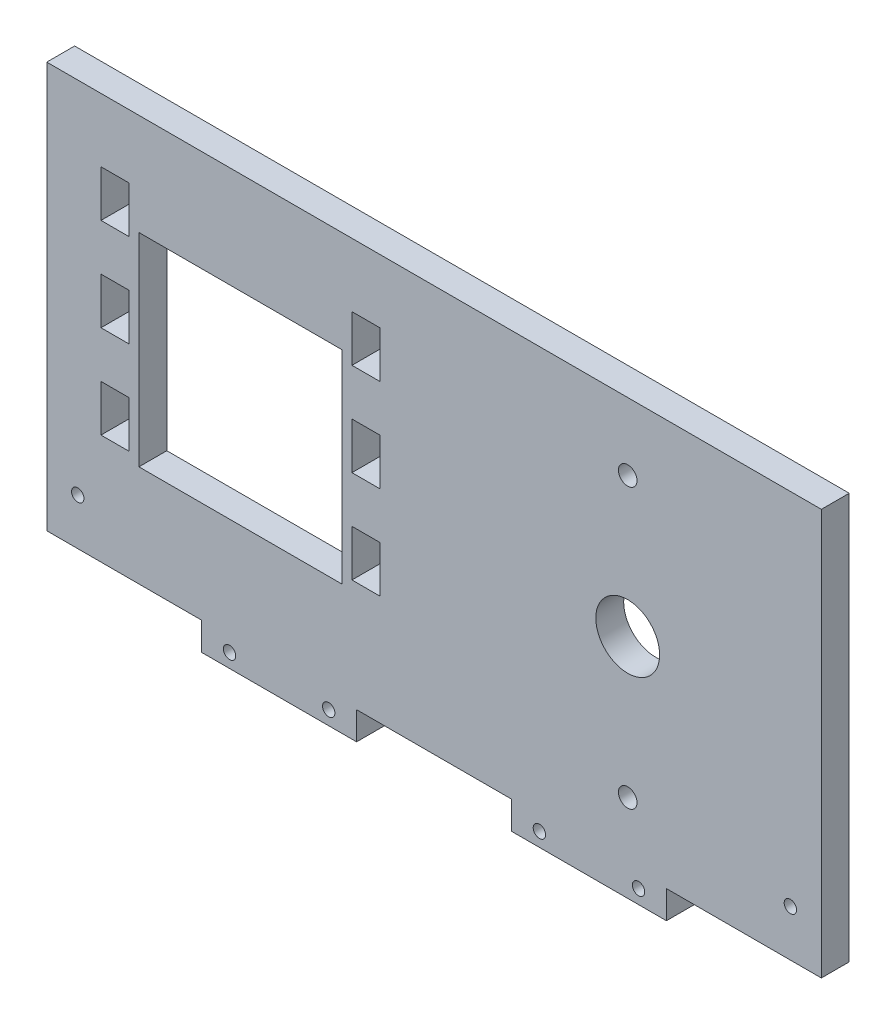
ISO-10303-21;
HEADER;
FILE_DESCRIPTION(('STEP AP214'),'2;1');
FILE_NAME('part.step','',(''),(''),'','','');
FILE_SCHEMA(('AUTOMOTIVE_DESIGN { 1 0 10303 214 1 1 1 1 }'));
ENDSEC;
DATA;
#1=APPLICATION_CONTEXT('core data for automotive mechanical design processes');
#2=APPLICATION_PROTOCOL_DEFINITION('international standard','automotive_design',2000,#1);
#3=PRODUCT_CONTEXT('',#1,'mechanical');
#4=PRODUCT('Part','Part','',(#3));
#5=PRODUCT_RELATED_PRODUCT_CATEGORY('part','',(#4));
#6=PRODUCT_DEFINITION_FORMATION('','',#4);
#7=PRODUCT_DEFINITION_CONTEXT('part definition',#1,'design');
#8=PRODUCT_DEFINITION('design','',#6,#7);
#9=PRODUCT_DEFINITION_SHAPE('','',#8);
#10=(LENGTH_UNIT() NAMED_UNIT(*) SI_UNIT(.MILLI.,.METRE.));
#11=(NAMED_UNIT(*) PLANE_ANGLE_UNIT() SI_UNIT($,.RADIAN.));
#12=(NAMED_UNIT(*) SI_UNIT($,.STERADIAN.) SOLID_ANGLE_UNIT());
#13=UNCERTAINTY_MEASURE_WITH_UNIT(LENGTH_MEASURE(1.E-05),#10,'distance_accuracy_value','');
#14=(GEOMETRIC_REPRESENTATION_CONTEXT(3) GLOBAL_UNCERTAINTY_ASSIGNED_CONTEXT((#13)) GLOBAL_UNIT_ASSIGNED_CONTEXT((#10,
#11,#12)) REPRESENTATION_CONTEXT('',''));
#15=CARTESIAN_POINT('',(0.,0.,0.));
#16=DIRECTION('',(0.,0.,1.));
#17=DIRECTION('',(1.,0.,0.));
#18=AXIS2_PLACEMENT_3D('',#15,#16,#17);
#19=CARTESIAN_POINT('',(-49.0030507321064,68.9522655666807,9.));
#20=DIRECTION('',(1.,0.,0.));
#21=DIRECTION('',(0.,0.,-1.));
#22=AXIS2_PLACEMENT_3D('',#19,#20,#21);
#23=PLANE('',#22);
#24=DIRECTION('',(0.,-1.,0.));
#25=VECTOR('',#24,1.);
#26=CARTESIAN_POINT('',(-49.0030507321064,68.9522655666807,0.));
#27=LINE('',#26,#25);
#28=CARTESIAN_POINT('',(-49.0030507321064,199.952265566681,0.));
#29=VERTEX_POINT('',#28);
#30=CARTESIAN_POINT('',(-49.0030507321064,68.9522655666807,0.));
#31=VERTEX_POINT('',#30);
#32=EDGE_CURVE('E575',#29,#31,#27,.T.);
#33=ORIENTED_EDGE('',*,*,#32,.T.);
#34=DIRECTION('',(0.,0.,-1.));
#35=VECTOR('',#34,1.);
#36=CARTESIAN_POINT('',(-49.0030507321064,68.9522655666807,9.));
#37=LINE('',#36,#35);
#38=CARTESIAN_POINT('',(-49.0030507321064,68.9522655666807,9.));
#39=VERTEX_POINT('',#38);
#40=EDGE_CURVE('E11',#39,#31,#37,.T.);
#41=ORIENTED_EDGE('',*,*,#40,.F.);
#42=DIRECTION('',(0.,-1.,0.));
#43=VECTOR('',#42,1.);
#44=CARTESIAN_POINT('',(-49.0030507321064,68.9522655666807,9.));
#45=LINE('',#44,#43);
#46=CARTESIAN_POINT('',(-49.0030507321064,199.952265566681,9.));
#47=VERTEX_POINT('',#46);
#48=EDGE_CURVE('E576',#47,#39,#45,.T.);
#49=ORIENTED_EDGE('',*,*,#48,.F.);
#50=DIRECTION('',(0.,0.,-1.));
#51=VECTOR('',#50,1.);
#52=CARTESIAN_POINT('',(-49.0030507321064,199.952265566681,9.));
#53=LINE('',#52,#51);
#54=EDGE_CURVE('E602',#47,#29,#53,.T.);
#55=ORIENTED_EDGE('',*,*,#54,.T.);
#56=EDGE_LOOP('',(#33,#41,#49,#55));
#57=FACE_BOUND('',#56,.T.);
#58=ADVANCED_FACE('F34',(#57),#23,.F.);
#59=CARTESIAN_POINT('',(-49.0030507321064,68.9522655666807,9.));
#60=DIRECTION('',(0.,1.,0.));
#61=DIRECTION('',(0.,0.,1.));
#62=AXIS2_PLACEMENT_3D('',#59,#60,#61);
#63=PLANE('',#62);
#64=DIRECTION('',(1.,0.,0.));
#65=VECTOR('',#64,1.);
#66=CARTESIAN_POINT('',(-49.0030507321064,68.9522655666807,0.));
#67=LINE('',#66,#65);
#68=CARTESIAN_POINT('',(0.996949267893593,68.9522655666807,0.));
#69=VERTEX_POINT('',#68);
#70=EDGE_CURVE('E605',#31,#69,#67,.T.);
#71=ORIENTED_EDGE('',*,*,#70,.T.);
#72=DIRECTION('',(0.,0.,-1.));
#73=VECTOR('',#72,1.);
#74=CARTESIAN_POINT('',(0.996949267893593,68.9522655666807,9.));
#75=LINE('',#74,#73);
#76=CARTESIAN_POINT('',(0.996949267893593,68.9522655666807,9.));
#77=VERTEX_POINT('',#76);
#78=EDGE_CURVE('E42',#77,#69,#75,.T.);
#79=ORIENTED_EDGE('',*,*,#78,.F.);
#80=DIRECTION('',(1.,0.,0.));
#81=VECTOR('',#80,1.);
#82=CARTESIAN_POINT('',(-49.0030507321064,68.9522655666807,9.));
#83=LINE('',#82,#81);
#84=EDGE_CURVE('E579',#39,#77,#83,.T.);
#85=ORIENTED_EDGE('',*,*,#84,.F.);
#86=ORIENTED_EDGE('',*,*,#40,.T.);
#87=EDGE_LOOP('',(#71,#79,#85,#86));
#88=FACE_BOUND('',#87,.T.);
#89=ADVANCED_FACE('F708',(#88),#63,.F.);
#90=CARTESIAN_POINT('',(0.996949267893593,68.9522655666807,9.));
#91=DIRECTION('',(1.,0.,0.));
#92=DIRECTION('',(0.,0.,-1.));
#93=AXIS2_PLACEMENT_3D('',#90,#91,#92);
#94=PLANE('',#93);
#95=DIRECTION('',(0.,-1.,0.));
#96=VECTOR('',#95,1.);
#97=CARTESIAN_POINT('',(0.996949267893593,68.9522655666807,0.));
#98=LINE('',#97,#96);
#99=CARTESIAN_POINT('',(0.996949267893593,59.9522655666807,0.));
#100=VERTEX_POINT('',#99);
#101=EDGE_CURVE('E607',#69,#100,#98,.T.);
#102=ORIENTED_EDGE('',*,*,#101,.T.);
#103=DIRECTION('',(0.,0.,-1.));
#104=VECTOR('',#103,1.);
#105=CARTESIAN_POINT('',(0.996949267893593,59.9522655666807,9.));
#106=LINE('',#105,#104);
#107=CARTESIAN_POINT('',(0.996949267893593,59.9522655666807,9.));
#108=VERTEX_POINT('',#107);
#109=EDGE_CURVE('E652',#108,#100,#106,.T.);
#110=ORIENTED_EDGE('',*,*,#109,.F.);
#111=DIRECTION('',(0.,-1.,0.));
#112=VECTOR('',#111,1.);
#113=CARTESIAN_POINT('',(0.996949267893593,68.9522655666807,9.));
#114=LINE('',#113,#112);
#115=EDGE_CURVE('E582',#77,#108,#114,.T.);
#116=ORIENTED_EDGE('',*,*,#115,.F.);
#117=ORIENTED_EDGE('',*,*,#78,.T.);
#118=EDGE_LOOP('',(#102,#110,#116,#117));
#119=FACE_BOUND('',#118,.T.);
#120=ADVANCED_FACE('F713',(#119),#94,.F.);
#121=CARTESIAN_POINT('',(0.996949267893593,59.9522655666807,9.));
#122=DIRECTION('',(0.,1.,0.));
#123=DIRECTION('',(0.,0.,1.));
#124=AXIS2_PLACEMENT_3D('',#121,#122,#123);
#125=PLANE('',#124);
#126=DIRECTION('',(1.,0.,0.));
#127=VECTOR('',#126,1.);
#128=CARTESIAN_POINT('',(0.996949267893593,59.9522655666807,0.));
#129=LINE('',#128,#127);
#130=CARTESIAN_POINT('',(50.9969492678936,59.9522655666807,0.));
#131=VERTEX_POINT('',#130);
#132=EDGE_CURVE('E609',#100,#131,#129,.T.);
#133=ORIENTED_EDGE('',*,*,#132,.T.);
#134=DIRECTION('',(0.,0.,-1.));
#135=VECTOR('',#134,1.);
#136=CARTESIAN_POINT('',(50.9969492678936,59.9522655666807,9.));
#137=LINE('',#136,#135);
#138=CARTESIAN_POINT('',(50.9969492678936,59.9522655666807,9.));
#139=VERTEX_POINT('',#138);
#140=EDGE_CURVE('E649',#139,#131,#137,.T.);
#141=ORIENTED_EDGE('',*,*,#140,.F.);
#142=DIRECTION('',(1.,0.,0.));
#143=VECTOR('',#142,1.);
#144=CARTESIAN_POINT('',(0.996949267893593,59.9522655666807,9.));
#145=LINE('',#144,#143);
#146=EDGE_CURVE('E584',#108,#139,#145,.T.);
#147=ORIENTED_EDGE('',*,*,#146,.F.);
#148=ORIENTED_EDGE('',*,*,#109,.T.);
#149=EDGE_LOOP('',(#133,#141,#147,#148));
#150=FACE_BOUND('',#149,.T.);
#151=ADVANCED_FACE('F719',(#150),#125,.F.);
#152=CARTESIAN_POINT('',(50.9969492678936,59.9522655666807,9.));
#153=DIRECTION('',(-1.,0.,0.));
#154=DIRECTION('',(0.,0.,1.));
#155=AXIS2_PLACEMENT_3D('',#152,#153,#154);
#156=PLANE('',#155);
#157=DIRECTION('',(0.,1.,0.));
#158=VECTOR('',#157,1.);
#159=CARTESIAN_POINT('',(50.9969492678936,59.9522655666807,0.));
#160=LINE('',#159,#158);
#161=CARTESIAN_POINT('',(50.9969492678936,68.9522655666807,0.));
#162=VERTEX_POINT('',#161);
#163=EDGE_CURVE('E611',#131,#162,#160,.T.);
#164=ORIENTED_EDGE('',*,*,#163,.T.);
#165=DIRECTION('',(0.,0.,-1.));
#166=VECTOR('',#165,1.);
#167=CARTESIAN_POINT('',(50.9969492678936,68.9522655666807,9.));
#168=LINE('',#167,#166);
#169=CARTESIAN_POINT('',(50.9969492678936,68.9522655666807,9.));
#170=VERTEX_POINT('',#169);
#171=EDGE_CURVE('E646',#170,#162,#168,.T.);
#172=ORIENTED_EDGE('',*,*,#171,.F.);
#173=DIRECTION('',(0.,1.,0.));
#174=VECTOR('',#173,1.);
#175=CARTESIAN_POINT('',(50.9969492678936,59.9522655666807,9.));
#176=LINE('',#175,#174);
#177=EDGE_CURVE('E586',#139,#170,#176,.T.);
#178=ORIENTED_EDGE('',*,*,#177,.F.);
#179=ORIENTED_EDGE('',*,*,#140,.T.);
#180=EDGE_LOOP('',(#164,#172,#178,#179));
#181=FACE_BOUND('',#180,.T.);
#182=ADVANCED_FACE('F723',(#181),#156,.F.);
#183=CARTESIAN_POINT('',(50.9969492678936,68.9522655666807,9.));
#184=DIRECTION('',(0.,1.,0.));
#185=DIRECTION('',(0.,0.,1.));
#186=AXIS2_PLACEMENT_3D('',#183,#184,#185);
#187=PLANE('',#186);
#188=DIRECTION('',(1.,0.,0.));
#189=VECTOR('',#188,1.);
#190=CARTESIAN_POINT('',(50.9969492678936,68.9522655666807,0.));
#191=LINE('',#190,#189);
#192=CARTESIAN_POINT('',(100.996949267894,68.9522655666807,0.));
#193=VERTEX_POINT('',#192);
#194=EDGE_CURVE('E613',#162,#193,#191,.T.);
#195=ORIENTED_EDGE('',*,*,#194,.T.);
#196=DIRECTION('',(0.,0.,-1.));
#197=VECTOR('',#196,1.);
#198=CARTESIAN_POINT('',(100.996949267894,68.9522655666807,9.));
#199=LINE('',#198,#197);
#200=CARTESIAN_POINT('',(100.996949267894,68.9522655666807,9.));
#201=VERTEX_POINT('',#200);
#202=EDGE_CURVE('E643',#201,#193,#199,.T.);
#203=ORIENTED_EDGE('',*,*,#202,.F.);
#204=DIRECTION('',(1.,0.,0.));
#205=VECTOR('',#204,1.);
#206=CARTESIAN_POINT('',(50.9969492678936,68.9522655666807,9.));
#207=LINE('',#206,#205);
#208=EDGE_CURVE('E588',#170,#201,#207,.T.);
#209=ORIENTED_EDGE('',*,*,#208,.F.);
#210=ORIENTED_EDGE('',*,*,#171,.T.);
#211=EDGE_LOOP('',(#195,#203,#209,#210));
#212=FACE_BOUND('',#211,.T.);
#213=ADVANCED_FACE('F728',(#212),#187,.F.);
#214=CARTESIAN_POINT('',(100.996949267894,68.9522655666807,9.));
#215=DIRECTION('',(1.,0.,0.));
#216=DIRECTION('',(0.,0.,-1.));
#217=AXIS2_PLACEMENT_3D('',#214,#215,#216);
#218=PLANE('',#217);
#219=DIRECTION('',(0.,-1.,0.));
#220=VECTOR('',#219,1.);
#221=CARTESIAN_POINT('',(100.996949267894,68.9522655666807,0.));
#222=LINE('',#221,#220);
#223=CARTESIAN_POINT('',(100.996949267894,59.9522655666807,0.));
#224=VERTEX_POINT('',#223);
#225=EDGE_CURVE('E615',#193,#224,#222,.T.);
#226=ORIENTED_EDGE('',*,*,#225,.T.);
#227=DIRECTION('',(0.,0.,-1.));
#228=VECTOR('',#227,1.);
#229=CARTESIAN_POINT('',(100.996949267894,59.9522655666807,9.));
#230=LINE('',#229,#228);
#231=CARTESIAN_POINT('',(100.996949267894,59.9522655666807,9.));
#232=VERTEX_POINT('',#231);
#233=EDGE_CURVE('E640',#232,#224,#230,.T.);
#234=ORIENTED_EDGE('',*,*,#233,.F.);
#235=DIRECTION('',(0.,-1.,0.));
#236=VECTOR('',#235,1.);
#237=CARTESIAN_POINT('',(100.996949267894,68.9522655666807,9.));
#238=LINE('',#237,#236);
#239=EDGE_CURVE('E590',#201,#232,#238,.T.);
#240=ORIENTED_EDGE('',*,*,#239,.F.);
#241=ORIENTED_EDGE('',*,*,#202,.T.);
#242=EDGE_LOOP('',(#226,#234,#240,#241));
#243=FACE_BOUND('',#242,.T.);
#244=ADVANCED_FACE('F734',(#243),#218,.F.);
#245=CARTESIAN_POINT('',(100.996949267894,59.9522655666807,9.));
#246=DIRECTION('',(0.,1.,0.));
#247=DIRECTION('',(0.,0.,1.));
#248=AXIS2_PLACEMENT_3D('',#245,#246,#247);
#249=PLANE('',#248);
#250=DIRECTION('',(1.,0.,0.));
#251=VECTOR('',#250,1.);
#252=CARTESIAN_POINT('',(100.996949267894,59.9522655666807,0.));
#253=LINE('',#252,#251);
#254=CARTESIAN_POINT('',(150.996949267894,59.9522655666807,0.));
#255=VERTEX_POINT('',#254);
#256=EDGE_CURVE('E617',#224,#255,#253,.T.);
#257=ORIENTED_EDGE('',*,*,#256,.T.);
#258=DIRECTION('',(0.,0.,-1.));
#259=VECTOR('',#258,1.);
#260=CARTESIAN_POINT('',(150.996949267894,59.9522655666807,9.));
#261=LINE('',#260,#259);
#262=CARTESIAN_POINT('',(150.996949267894,59.9522655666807,9.));
#263=VERTEX_POINT('',#262);
#264=EDGE_CURVE('E637',#263,#255,#261,.T.);
#265=ORIENTED_EDGE('',*,*,#264,.F.);
#266=DIRECTION('',(1.,0.,0.));
#267=VECTOR('',#266,1.);
#268=CARTESIAN_POINT('',(100.996949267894,59.9522655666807,9.));
#269=LINE('',#268,#267);
#270=EDGE_CURVE('E592',#232,#263,#269,.T.);
#271=ORIENTED_EDGE('',*,*,#270,.F.);
#272=ORIENTED_EDGE('',*,*,#233,.T.);
#273=EDGE_LOOP('',(#257,#265,#271,#272));
#274=FACE_BOUND('',#273,.T.);
#275=ADVANCED_FACE('F738',(#274),#249,.F.);
#276=CARTESIAN_POINT('',(150.996949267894,59.9522655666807,9.));
#277=DIRECTION('',(-1.,0.,0.));
#278=DIRECTION('',(0.,0.,1.));
#279=AXIS2_PLACEMENT_3D('',#276,#277,#278);
#280=PLANE('',#279);
#281=DIRECTION('',(0.,1.,0.));
#282=VECTOR('',#281,1.);
#283=CARTESIAN_POINT('',(150.996949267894,59.9522655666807,0.));
#284=LINE('',#283,#282);
#285=CARTESIAN_POINT('',(150.996949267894,68.9522655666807,0.));
#286=VERTEX_POINT('',#285);
#287=EDGE_CURVE('E619',#255,#286,#284,.T.);
#288=ORIENTED_EDGE('',*,*,#287,.T.);
#289=DIRECTION('',(0.,0.,-1.));
#290=VECTOR('',#289,1.);
#291=CARTESIAN_POINT('',(150.996949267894,68.9522655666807,9.));
#292=LINE('',#291,#290);
#293=CARTESIAN_POINT('',(150.996949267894,68.9522655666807,9.));
#294=VERTEX_POINT('',#293);
#295=EDGE_CURVE('E634',#294,#286,#292,.T.);
#296=ORIENTED_EDGE('',*,*,#295,.F.);
#297=DIRECTION('',(0.,1.,0.));
#298=VECTOR('',#297,1.);
#299=CARTESIAN_POINT('',(150.996949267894,59.9522655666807,9.));
#300=LINE('',#299,#298);
#301=EDGE_CURVE('E594',#263,#294,#300,.T.);
#302=ORIENTED_EDGE('',*,*,#301,.F.);
#303=ORIENTED_EDGE('',*,*,#264,.T.);
#304=EDGE_LOOP('',(#288,#296,#302,#303));
#305=FACE_BOUND('',#304,.T.);
#306=ADVANCED_FACE('F743',(#305),#280,.F.);
#307=CARTESIAN_POINT('',(150.996949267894,68.9522655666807,9.));
#308=DIRECTION('',(0.,1.,0.));
#309=DIRECTION('',(0.,0.,1.));
#310=AXIS2_PLACEMENT_3D('',#307,#308,#309);
#311=PLANE('',#310);
#312=DIRECTION('',(1.,0.,0.));
#313=VECTOR('',#312,1.);
#314=CARTESIAN_POINT('',(150.996949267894,68.9522655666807,0.));
#315=LINE('',#314,#313);
#316=CARTESIAN_POINT('',(200.996949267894,68.9522655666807,0.));
#317=VERTEX_POINT('',#316);
#318=EDGE_CURVE('E621',#286,#317,#315,.T.);
#319=ORIENTED_EDGE('',*,*,#318,.T.);
#320=DIRECTION('',(0.,0.,-1.));
#321=VECTOR('',#320,1.);
#322=CARTESIAN_POINT('',(200.996949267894,68.9522655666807,9.));
#323=LINE('',#322,#321);
#324=CARTESIAN_POINT('',(200.996949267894,68.9522655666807,9.));
#325=VERTEX_POINT('',#324);
#326=EDGE_CURVE('E631',#325,#317,#323,.T.);
#327=ORIENTED_EDGE('',*,*,#326,.F.);
#328=DIRECTION('',(1.,0.,0.));
#329=VECTOR('',#328,1.);
#330=CARTESIAN_POINT('',(150.996949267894,68.9522655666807,9.));
#331=LINE('',#330,#329);
#332=EDGE_CURVE('E596',#294,#325,#331,.T.);
#333=ORIENTED_EDGE('',*,*,#332,.F.);
#334=ORIENTED_EDGE('',*,*,#295,.T.);
#335=EDGE_LOOP('',(#319,#327,#333,#334));
#336=FACE_BOUND('',#335,.T.);
#337=ADVANCED_FACE('F749',(#336),#311,.F.);
#338=CARTESIAN_POINT('',(200.996949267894,199.952265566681,9.));
#339=DIRECTION('',(-1.,0.,0.));
#340=DIRECTION('',(0.,-1.,0.));
#341=AXIS2_PLACEMENT_3D('',#338,#339,#340);
#342=PLANE('',#341);
#343=DIRECTION('',(0.,1.,0.));
#344=VECTOR('',#343,1.);
#345=CARTESIAN_POINT('',(200.996949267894,199.952265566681,0.));
#346=LINE('',#345,#344);
#347=CARTESIAN_POINT('',(200.996949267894,199.952265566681,0.));
#348=VERTEX_POINT('',#347);
#349=EDGE_CURVE('E623',#317,#348,#346,.T.);
#350=ORIENTED_EDGE('',*,*,#349,.T.);
#351=DIRECTION('',(0.,0.,-1.));
#352=VECTOR('',#351,1.);
#353=CARTESIAN_POINT('',(200.996949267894,199.952265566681,9.));
#354=LINE('',#353,#352);
#355=CARTESIAN_POINT('',(200.996949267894,199.952265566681,9.));
#356=VERTEX_POINT('',#355);
#357=EDGE_CURVE('E628',#356,#348,#354,.T.);
#358=ORIENTED_EDGE('',*,*,#357,.F.);
#359=DIRECTION('',(0.,1.,0.));
#360=VECTOR('',#359,1.);
#361=CARTESIAN_POINT('',(200.996949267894,199.952265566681,9.));
#362=LINE('',#361,#360);
#363=EDGE_CURVE('E598',#325,#356,#362,.T.);
#364=ORIENTED_EDGE('',*,*,#363,.F.);
#365=ORIENTED_EDGE('',*,*,#326,.T.);
#366=EDGE_LOOP('',(#350,#358,#364,#365));
#367=FACE_BOUND('',#366,.T.);
#368=ADVANCED_FACE('F753',(#367),#342,.F.);
#369=CARTESIAN_POINT('',(-49.0030507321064,199.952265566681,9.));
#370=DIRECTION('',(0.,-1.,0.));
#371=DIRECTION('',(0.,0.,-1.));
#372=AXIS2_PLACEMENT_3D('',#369,#370,#371);
#373=PLANE('',#372);
#374=DIRECTION('',(-1.,0.,0.));
#375=VECTOR('',#374,1.);
#376=CARTESIAN_POINT('',(-49.0030507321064,199.952265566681,0.));
#377=LINE('',#376,#375);
#378=EDGE_CURVE('E580',#348,#29,#377,.T.);
#379=ORIENTED_EDGE('',*,*,#378,.T.);
#380=ORIENTED_EDGE('',*,*,#54,.F.);
#381=DIRECTION('',(-1.,0.,0.));
#382=VECTOR('',#381,1.);
#383=CARTESIAN_POINT('',(-49.0030507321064,199.952265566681,9.));
#384=LINE('',#383,#382);
#385=EDGE_CURVE('E600',#356,#47,#384,.T.);
#386=ORIENTED_EDGE('',*,*,#385,.F.);
#387=ORIENTED_EDGE('',*,*,#357,.T.);
#388=EDGE_LOOP('',(#379,#380,#386,#387));
#389=FACE_BOUND('',#388,.T.);
#390=ADVANCED_FACE('F678',(#389),#373,.F.);
#391=CARTESIAN_POINT('',(0.,0.,9.));
#392=DIRECTION('',(0.,0.,-1.));
#393=DIRECTION('',(-1.,0.,0.));
#394=AXIS2_PLACEMENT_3D('',#391,#392,#393);
#395=PLANE('',#394);
#396=CARTESIAN_POINT('',(-39.0030507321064,83.9522655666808,9.));
#397=DIRECTION('',(0.,0.,1.));
#398=DIRECTION('',(1.,0.,0.));
#399=AXIS2_PLACEMENT_3D('',#396,#397,#398);
#400=CIRCLE('',#399,2.);
#401=CARTESIAN_POINT('',(-37.0030507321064,83.9522655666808,9.));
#402=VERTEX_POINT('',#401);
#403=EDGE_CURVE('E667',#402,#402,#400,.T.);
#404=ORIENTED_EDGE('',*,*,#403,.F.);
#405=EDGE_LOOP('',(#404));
#406=FACE_BOUND('',#405,.T.);
#407=CARTESIAN_POINT('',(190.996949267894,83.9522655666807,9.));
#408=DIRECTION('',(0.,0.,1.));
#409=DIRECTION('',(1.,0.,0.));
#410=AXIS2_PLACEMENT_3D('',#407,#408,#409);
#411=CIRCLE('',#410,2.00000000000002);
#412=CARTESIAN_POINT('',(192.996949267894,83.9522655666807,9.));
#413=VERTEX_POINT('',#412);
#414=EDGE_CURVE('E659',#413,#413,#411,.T.);
#415=ORIENTED_EDGE('',*,*,#414,.F.);
#416=EDGE_LOOP('',(#415));
#417=FACE_BOUND('',#416,.T.);
#418=DIRECTION('',(-1.,0.,0.));
#419=VECTOR('',#418,1.);
#420=CARTESIAN_POINT('',(0.,104.452265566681,9.));
#421=LINE('',#420,#419);
#422=CARTESIAN_POINT('',(-22.5030507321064,104.452265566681,9.));
#423=VERTEX_POINT('',#422);
#424=CARTESIAN_POINT('',(-31.5030507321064,104.452265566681,9.));
#425=VERTEX_POINT('',#424);
#426=EDGE_CURVE('E453',#423,#425,#421,.T.);
#427=ORIENTED_EDGE('',*,*,#426,.T.);
#428=DIRECTION('',(0.,1.,0.));
#429=VECTOR('',#428,1.);
#430=CARTESIAN_POINT('',(-31.5030507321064,0.,9.));
#431=LINE('',#430,#429);
#432=CARTESIAN_POINT('',(-31.5030507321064,119.452265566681,9.));
#433=VERTEX_POINT('',#432);
#434=EDGE_CURVE('E456',#425,#433,#431,.T.);
#435=ORIENTED_EDGE('',*,*,#434,.T.);
#436=DIRECTION('',(1.,0.,0.));
#437=VECTOR('',#436,1.);
#438=CARTESIAN_POINT('',(0.,119.452265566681,9.));
#439=LINE('',#438,#437);
#440=CARTESIAN_POINT('',(-22.5030507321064,119.452265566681,9.));
#441=VERTEX_POINT('',#440);
#442=EDGE_CURVE('E447',#433,#441,#439,.T.);
#443=ORIENTED_EDGE('',*,*,#442,.T.);
#444=DIRECTION('',(0.,-1.,0.));
#445=VECTOR('',#444,1.);
#446=CARTESIAN_POINT('',(-22.5030507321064,0.,9.));
#447=LINE('',#446,#445);
#448=EDGE_CURVE('E450',#441,#423,#447,.T.);
#449=ORIENTED_EDGE('',*,*,#448,.T.);
#450=EDGE_LOOP('',(#427,#435,#443,#449));
#451=FACE_BOUND('',#450,.T.);
#452=DIRECTION('',(1.,0.,0.));
#453=VECTOR('',#452,1.);
#454=CARTESIAN_POINT('',(0.,119.452265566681,9.));
#455=LINE('',#454,#453);
#456=CARTESIAN_POINT('',(49.4969492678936,119.452265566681,9.));
#457=VERTEX_POINT('',#456);
#458=CARTESIAN_POINT('',(58.4969492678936,119.452265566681,9.));
#459=VERTEX_POINT('',#458);
#460=EDGE_CURVE('E441',#457,#459,#455,.T.);
#461=ORIENTED_EDGE('',*,*,#460,.T.);
#462=DIRECTION('',(0.,-1.,0.));
#463=VECTOR('',#462,1.);
#464=CARTESIAN_POINT('',(58.4969492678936,0.,9.));
#465=LINE('',#464,#463);
#466=CARTESIAN_POINT('',(58.4969492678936,104.452265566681,9.));
#467=VERTEX_POINT('',#466);
#468=EDGE_CURVE('E444',#459,#467,#465,.T.);
#469=ORIENTED_EDGE('',*,*,#468,.T.);
#470=DIRECTION('',(-1.,0.,0.));
#471=VECTOR('',#470,1.);
#472=CARTESIAN_POINT('',(0.,104.452265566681,9.));
#473=LINE('',#472,#471);
#474=CARTESIAN_POINT('',(49.4969492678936,104.452265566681,9.));
#475=VERTEX_POINT('',#474);
#476=EDGE_CURVE('E438',#467,#475,#473,.T.);
#477=ORIENTED_EDGE('',*,*,#476,.T.);
#478=DIRECTION('',(0.,1.,0.));
#479=VECTOR('',#478,1.);
#480=CARTESIAN_POINT('',(49.4969492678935,0.,9.));
#481=LINE('',#480,#479);
#482=EDGE_CURVE('E297',#475,#457,#481,.T.);
#483=ORIENTED_EDGE('',*,*,#482,.T.);
#484=EDGE_LOOP('',(#461,#469,#477,#483));
#485=FACE_BOUND('',#484,.T.);
#486=DIRECTION('',(-1.,0.,0.));
#487=VECTOR('',#486,1.);
#488=CARTESIAN_POINT('',(0.,164.452265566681,9.));
#489=LINE('',#488,#487);
#490=CARTESIAN_POINT('',(-22.5030507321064,164.452265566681,9.));
#491=VERTEX_POINT('',#490);
#492=CARTESIAN_POINT('',(-31.5030507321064,164.452265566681,9.));
#493=VERTEX_POINT('',#492);
#494=EDGE_CURVE('E432',#491,#493,#489,.T.);
#495=ORIENTED_EDGE('',*,*,#494,.T.);
#496=DIRECTION('',(0.,1.,0.));
#497=VECTOR('',#496,1.);
#498=CARTESIAN_POINT('',(-31.5030507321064,0.,9.));
#499=LINE('',#498,#497);
#500=CARTESIAN_POINT('',(-31.5030507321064,179.452265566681,9.));
#501=VERTEX_POINT('',#500);
#502=EDGE_CURVE('E435',#493,#501,#499,.T.);
#503=ORIENTED_EDGE('',*,*,#502,.T.);
#504=DIRECTION('',(1.,0.,0.));
#505=VECTOR('',#504,1.);
#506=CARTESIAN_POINT('',(0.,179.452265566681,9.));
#507=LINE('',#506,#505);
#508=CARTESIAN_POINT('',(-22.5030507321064,179.452265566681,9.));
#509=VERTEX_POINT('',#508);
#510=EDGE_CURVE('E426',#501,#509,#507,.T.);
#511=ORIENTED_EDGE('',*,*,#510,.T.);
#512=DIRECTION('',(0.,-1.,0.));
#513=VECTOR('',#512,1.);
#514=CARTESIAN_POINT('',(-22.5030507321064,0.,9.));
#515=LINE('',#514,#513);
#516=EDGE_CURVE('E429',#509,#491,#515,.T.);
#517=ORIENTED_EDGE('',*,*,#516,.T.);
#518=EDGE_LOOP('',(#495,#503,#511,#517));
#519=FACE_BOUND('',#518,.T.);
#520=DIRECTION('',(0.,1.,0.));
#521=VECTOR('',#520,1.);
#522=CARTESIAN_POINT('',(49.4969492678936,0.,9.));
#523=LINE('',#522,#521);
#524=CARTESIAN_POINT('',(49.4969492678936,164.452265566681,9.));
#525=VERTEX_POINT('',#524);
#526=CARTESIAN_POINT('',(49.4969492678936,179.452265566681,9.));
#527=VERTEX_POINT('',#526);
#528=EDGE_CURVE('E420',#525,#527,#523,.T.);
#529=ORIENTED_EDGE('',*,*,#528,.T.);
#530=DIRECTION('',(1.,0.,0.));
#531=VECTOR('',#530,1.);
#532=CARTESIAN_POINT('',(0.,179.452265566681,9.));
#533=LINE('',#532,#531);
#534=CARTESIAN_POINT('',(58.4969492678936,179.452265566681,9.));
#535=VERTEX_POINT('',#534);
#536=EDGE_CURVE('E423',#527,#535,#533,.T.);
#537=ORIENTED_EDGE('',*,*,#536,.T.);
#538=DIRECTION('',(0.,-1.,0.));
#539=VECTOR('',#538,1.);
#540=CARTESIAN_POINT('',(58.4969492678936,0.,9.));
#541=LINE('',#540,#539);
#542=CARTESIAN_POINT('',(58.4969492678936,164.452265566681,9.));
#543=VERTEX_POINT('',#542);
#544=EDGE_CURVE('E414',#535,#543,#541,.T.);
#545=ORIENTED_EDGE('',*,*,#544,.T.);
#546=DIRECTION('',(-1.,0.,0.));
#547=VECTOR('',#546,1.);
#548=CARTESIAN_POINT('',(0.,164.452265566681,9.));
#549=LINE('',#548,#547);
#550=EDGE_CURVE('E417',#543,#525,#549,.T.);
#551=ORIENTED_EDGE('',*,*,#550,.T.);
#552=EDGE_LOOP('',(#529,#537,#545,#551));
#553=FACE_BOUND('',#552,.T.);
#554=DIRECTION('',(0.,-1.,0.));
#555=VECTOR('',#554,1.);
#556=CARTESIAN_POINT('',(58.4969492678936,0.,9.));
#557=LINE('',#556,#555);
#558=CARTESIAN_POINT('',(58.4969492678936,149.452265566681,9.));
#559=VERTEX_POINT('',#558);
#560=CARTESIAN_POINT('',(58.4969492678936,134.452265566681,9.));
#561=VERTEX_POINT('',#560);
#562=EDGE_CURVE('E408',#559,#561,#557,.T.);
#563=ORIENTED_EDGE('',*,*,#562,.T.);
#564=DIRECTION('',(-1.,0.,0.));
#565=VECTOR('',#564,1.);
#566=CARTESIAN_POINT('',(8.29288894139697E-13,134.452265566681,9.));
#567=LINE('',#566,#565);
#568=CARTESIAN_POINT('',(49.4969492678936,134.452265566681,9.));
#569=VERTEX_POINT('',#568);
#570=EDGE_CURVE('E411',#561,#569,#567,.T.);
#571=ORIENTED_EDGE('',*,*,#570,.T.);
#572=DIRECTION('',(0.,1.,0.));
#573=VECTOR('',#572,1.);
#574=CARTESIAN_POINT('',(49.4969492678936,0.,9.));
#575=LINE('',#574,#573);
#576=CARTESIAN_POINT('',(49.4969492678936,149.452265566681,9.));
#577=VERTEX_POINT('',#576);
#578=EDGE_CURVE('E378',#569,#577,#575,.T.);
#579=ORIENTED_EDGE('',*,*,#578,.T.);
#580=DIRECTION('',(1.,0.,0.));
#581=VECTOR('',#580,1.);
#582=CARTESIAN_POINT('',(0.,149.452265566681,9.));
#583=LINE('',#582,#581);
#584=EDGE_CURVE('E405',#577,#559,#583,.T.);
#585=ORIENTED_EDGE('',*,*,#584,.T.);
#586=EDGE_LOOP('',(#563,#571,#579,#585));
#587=FACE_BOUND('',#586,.T.);
#588=DIRECTION('',(1.,0.,0.));
#589=VECTOR('',#588,1.);
#590=CARTESIAN_POINT('',(0.,149.452265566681,9.));
#591=LINE('',#590,#589);
#592=CARTESIAN_POINT('',(-31.5030507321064,149.452265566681,9.));
#593=VERTEX_POINT('',#592);
#594=CARTESIAN_POINT('',(-22.5030507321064,149.452265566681,9.));
#595=VERTEX_POINT('',#594);
#596=EDGE_CURVE('E485',#593,#595,#591,.T.);
#597=ORIENTED_EDGE('',*,*,#596,.T.);
#598=DIRECTION('',(0.,-1.,0.));
#599=VECTOR('',#598,1.);
#600=CARTESIAN_POINT('',(-22.5030507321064,0.,9.));
#601=LINE('',#600,#599);
#602=CARTESIAN_POINT('',(-22.5030507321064,134.452265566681,9.));
#603=VERTEX_POINT('',#602);
#604=EDGE_CURVE('E488',#595,#603,#601,.T.);
#605=ORIENTED_EDGE('',*,*,#604,.T.);
#606=DIRECTION('',(-1.,0.,0.));
#607=VECTOR('',#606,1.);
#608=CARTESIAN_POINT('',(-8.29288894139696E-13,134.452265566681,9.));
#609=LINE('',#608,#607);
#610=CARTESIAN_POINT('',(-31.5030507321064,134.452265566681,9.));
#611=VERTEX_POINT('',#610);
#612=EDGE_CURVE('E473',#603,#611,#609,.T.);
#613=ORIENTED_EDGE('',*,*,#612,.T.);
#614=DIRECTION('',(0.,1.,0.));
#615=VECTOR('',#614,1.);
#616=CARTESIAN_POINT('',(-31.5030507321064,0.,9.));
#617=LINE('',#616,#615);
#618=EDGE_CURVE('E482',#611,#593,#617,.T.);
#619=ORIENTED_EDGE('',*,*,#618,.T.);
#620=EDGE_LOOP('',(#597,#605,#613,#619));
#621=FACE_BOUND('',#620,.T.);
#622=DIRECTION('',(-1.,0.,0.));
#623=VECTOR('',#622,1.);
#624=CARTESIAN_POINT('',(0.,101.702265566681,9.));
#625=LINE('',#624,#623);
#626=CARTESIAN_POINT('',(46.2469492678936,101.702265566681,9.));
#627=VERTEX_POINT('',#626);
#628=CARTESIAN_POINT('',(-19.2530507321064,101.702265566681,9.));
#629=VERTEX_POINT('',#628);
#630=EDGE_CURVE('E517',#627,#629,#625,.T.);
#631=ORIENTED_EDGE('',*,*,#630,.T.);
#632=DIRECTION('',(0.,1.,0.));
#633=VECTOR('',#632,1.);
#634=CARTESIAN_POINT('',(-19.2530507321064,0.,9.));
#635=LINE('',#634,#633);
#636=CARTESIAN_POINT('',(-19.2530507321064,167.202265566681,9.));
#637=VERTEX_POINT('',#636);
#638=EDGE_CURVE('E520',#629,#637,#635,.T.);
#639=ORIENTED_EDGE('',*,*,#638,.T.);
#640=DIRECTION('',(1.,0.,0.));
#641=VECTOR('',#640,1.);
#642=CARTESIAN_POINT('',(0.,167.202265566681,9.));
#643=LINE('',#642,#641);
#644=CARTESIAN_POINT('',(46.2469492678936,167.202265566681,9.));
#645=VERTEX_POINT('',#644);
#646=EDGE_CURVE('E505',#637,#645,#643,.T.);
#647=ORIENTED_EDGE('',*,*,#646,.T.);
#648=DIRECTION('',(0.,-1.,0.));
#649=VECTOR('',#648,1.);
#650=CARTESIAN_POINT('',(46.2469492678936,0.,9.));
#651=LINE('',#650,#649);
#652=EDGE_CURVE('E514',#645,#627,#651,.T.);
#653=ORIENTED_EDGE('',*,*,#652,.T.);
#654=EDGE_LOOP('',(#631,#639,#647,#653));
#655=FACE_BOUND('',#654,.T.);
#656=CARTESIAN_POINT('',(138.496949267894,178.166228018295,9.));
#657=DIRECTION('',(0.,0.,1.));
#658=DIRECTION('',(1.,0.,0.));
#659=AXIS2_PLACEMENT_3D('',#656,#657,#658);
#660=CIRCLE('',#659,2.99999999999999);
#661=CARTESIAN_POINT('',(141.496949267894,178.166228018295,9.));
#662=VERTEX_POINT('',#661);
#663=EDGE_CURVE('E523',#662,#662,#660,.T.);
#664=ORIENTED_EDGE('',*,*,#663,.F.);
#665=EDGE_LOOP('',(#664));
#666=FACE_BOUND('',#665,.T.);
#667=CARTESIAN_POINT('',(138.496949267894,88.1662280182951,9.));
#668=DIRECTION('',(0.,0.,1.));
#669=DIRECTION('',(1.,0.,0.));
#670=AXIS2_PLACEMENT_3D('',#667,#668,#669);
#671=CIRCLE('',#670,2.99999999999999);
#672=CARTESIAN_POINT('',(141.496949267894,88.1662280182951,9.));
#673=VERTEX_POINT('',#672);
#674=EDGE_CURVE('E527',#673,#673,#671,.T.);
#675=ORIENTED_EDGE('',*,*,#674,.F.);
#676=EDGE_LOOP('',(#675));
#677=FACE_BOUND('',#676,.T.);
#678=CARTESIAN_POINT('',(138.496949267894,133.166228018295,9.));
#679=DIRECTION('',(0.,0.,-1.));
#680=DIRECTION('',(-1.,0.,0.));
#681=AXIS2_PLACEMENT_3D('',#678,#679,#680);
#682=CIRCLE('',#681,10.3);
#683=CARTESIAN_POINT('',(128.196949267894,133.166228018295,9.));
#684=VERTEX_POINT('',#683);
#685=EDGE_CURVE('E538',#684,#684,#682,.T.);
#686=ORIENTED_EDGE('',*,*,#685,.T.);
#687=EDGE_LOOP('',(#686));
#688=FACE_BOUND('',#687,.T.);
#689=CARTESIAN_POINT('',(41.9969492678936,64.4522655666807,9.));
#690=DIRECTION('',(0.,0.,1.));
#691=DIRECTION('',(1.,0.,0.));
#692=AXIS2_PLACEMENT_3D('',#689,#690,#691);
#693=CIRCLE('',#692,2.);
#694=CARTESIAN_POINT('',(43.9969492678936,64.4522655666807,9.));
#695=VERTEX_POINT('',#694);
#696=EDGE_CURVE('E563',#695,#695,#693,.T.);
#697=ORIENTED_EDGE('',*,*,#696,.F.);
#698=EDGE_LOOP('',(#697));
#699=FACE_BOUND('',#698,.T.);
#700=CARTESIAN_POINT('',(141.996949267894,64.4522655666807,9.));
#701=DIRECTION('',(0.,0.,1.));
#702=DIRECTION('',(-1.,0.,0.));
#703=AXIS2_PLACEMENT_3D('',#700,#701,#702);
#704=CIRCLE('',#703,2.);
#705=CARTESIAN_POINT('',(139.996949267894,64.4522655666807,9.));
#706=VERTEX_POINT('',#705);
#707=EDGE_CURVE('E567',#706,#706,#704,.T.);
#708=ORIENTED_EDGE('',*,*,#707,.F.);
#709=EDGE_LOOP('',(#708));
#710=FACE_BOUND('',#709,.T.);
#711=CARTESIAN_POINT('',(109.996949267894,64.4522655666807,9.));
#712=DIRECTION('',(0.,0.,1.));
#713=DIRECTION('',(-1.,0.,0.));
#714=AXIS2_PLACEMENT_3D('',#711,#712,#713);
#715=CIRCLE('',#714,2.);
#716=CARTESIAN_POINT('',(107.996949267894,64.4522655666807,9.));
#717=VERTEX_POINT('',#716);
#718=EDGE_CURVE('E570',#717,#717,#715,.T.);
#719=ORIENTED_EDGE('',*,*,#718,.F.);
#720=EDGE_LOOP('',(#719));
#721=FACE_BOUND('',#720,.T.);
#722=CARTESIAN_POINT('',(9.99694926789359,64.4522655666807,9.));
#723=DIRECTION('',(0.,0.,1.));
#724=DIRECTION('',(1.,0.,0.));
#725=AXIS2_PLACEMENT_3D('',#722,#723,#724);
#726=CIRCLE('',#725,2.);
#727=CARTESIAN_POINT('',(11.9969492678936,64.4522655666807,9.));
#728=VERTEX_POINT('',#727);
#729=EDGE_CURVE('E566',#728,#728,#726,.T.);
#730=ORIENTED_EDGE('',*,*,#729,.F.);
#731=EDGE_LOOP('',(#730));
#732=FACE_BOUND('',#731,.T.);
#733=ORIENTED_EDGE('',*,*,#48,.T.);
#734=ORIENTED_EDGE('',*,*,#84,.T.);
#735=ORIENTED_EDGE('',*,*,#115,.T.);
#736=ORIENTED_EDGE('',*,*,#146,.T.);
#737=ORIENTED_EDGE('',*,*,#177,.T.);
#738=ORIENTED_EDGE('',*,*,#208,.T.);
#739=ORIENTED_EDGE('',*,*,#239,.T.);
#740=ORIENTED_EDGE('',*,*,#270,.T.);
#741=ORIENTED_EDGE('',*,*,#301,.T.);
#742=ORIENTED_EDGE('',*,*,#332,.T.);
#743=ORIENTED_EDGE('',*,*,#363,.T.);
#744=ORIENTED_EDGE('',*,*,#385,.T.);
#745=EDGE_LOOP('',(#733,#734,#735,#736,#737,#738,#739,#740,#741,#742,#743,#744));
#746=FACE_BOUND('',#745,.T.);
#747=ADVANCED_FACE('F675',(#406,#417,#451,#485,#519,#553,#587,#621,#655,#666,#677,#688,#699,
#710,#721,#732,#746),#395,.F.);
#748=CARTESIAN_POINT('',(0.,0.,0.));
#749=DIRECTION('',(0.,0.,-1.));
#750=DIRECTION('',(-1.,0.,0.));
#751=AXIS2_PLACEMENT_3D('',#748,#749,#750);
#752=PLANE('',#751);
#753=CARTESIAN_POINT('',(-39.0030507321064,83.9522655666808,0.));
#754=DIRECTION('',(0.,0.,-1.));
#755=DIRECTION('',(-1.,0.,0.));
#756=AXIS2_PLACEMENT_3D('',#753,#754,#755);
#757=CIRCLE('',#756,2.);
#758=CARTESIAN_POINT('',(-41.0030507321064,83.9522655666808,0.));
#759=VERTEX_POINT('',#758);
#760=EDGE_CURVE('E37',#759,#759,#757,.T.);
#761=ORIENTED_EDGE('',*,*,#760,.F.);
#762=EDGE_LOOP('',(#761));
#763=FACE_BOUND('',#762,.T.);
#764=CARTESIAN_POINT('',(190.996949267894,83.9522655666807,0.));
#765=DIRECTION('',(0.,0.,-1.));
#766=DIRECTION('',(-1.,0.,0.));
#767=AXIS2_PLACEMENT_3D('',#764,#765,#766);
#768=CIRCLE('',#767,2.00000000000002);
#769=CARTESIAN_POINT('',(188.996949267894,83.9522655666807,0.));
#770=VERTEX_POINT('',#769);
#771=EDGE_CURVE('E327',#770,#770,#768,.T.);
#772=ORIENTED_EDGE('',*,*,#771,.F.);
#773=EDGE_LOOP('',(#772));
#774=FACE_BOUND('',#773,.T.);
#775=DIRECTION('',(0.,1.,0.));
#776=VECTOR('',#775,1.);
#777=CARTESIAN_POINT('',(-31.5030507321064,119.452265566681,0.));
#778=LINE('',#777,#776);
#779=CARTESIAN_POINT('',(-31.5030507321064,104.452265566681,0.));
#780=VERTEX_POINT('',#779);
#781=CARTESIAN_POINT('',(-31.5030507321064,119.452265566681,0.));
#782=VERTEX_POINT('',#781);
#783=EDGE_CURVE('E321',#780,#782,#778,.T.);
#784=ORIENTED_EDGE('',*,*,#783,.F.);
#785=DIRECTION('',(-1.,0.,0.));
#786=VECTOR('',#785,1.);
#787=CARTESIAN_POINT('',(-31.5030507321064,104.452265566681,0.));
#788=LINE('',#787,#786);
#789=CARTESIAN_POINT('',(-22.5030507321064,104.452265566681,0.));
#790=VERTEX_POINT('',#789);
#791=EDGE_CURVE('E351',#790,#780,#788,.T.);
#792=ORIENTED_EDGE('',*,*,#791,.F.);
#793=DIRECTION('',(0.,-1.,0.));
#794=VECTOR('',#793,1.);
#795=CARTESIAN_POINT('',(-22.5030507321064,119.452265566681,0.));
#796=LINE('',#795,#794);
#797=CARTESIAN_POINT('',(-22.5030507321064,119.452265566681,0.));
#798=VERTEX_POINT('',#797);
#799=EDGE_CURVE('E348',#798,#790,#796,.T.);
#800=ORIENTED_EDGE('',*,*,#799,.F.);
#801=DIRECTION('',(1.,0.,0.));
#802=VECTOR('',#801,1.);
#803=CARTESIAN_POINT('',(-22.5030507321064,119.452265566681,0.));
#804=LINE('',#803,#802);
#805=EDGE_CURVE('E346',#782,#798,#804,.T.);
#806=ORIENTED_EDGE('',*,*,#805,.F.);
#807=EDGE_LOOP('',(#784,#792,#800,#806));
#808=FACE_BOUND('',#807,.T.);
#809=DIRECTION('',(0.,-1.,0.));
#810=VECTOR('',#809,1.);
#811=CARTESIAN_POINT('',(58.4969492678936,119.452265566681,0.));
#812=LINE('',#811,#810);
#813=CARTESIAN_POINT('',(58.4969492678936,119.452265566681,0.));
#814=VERTEX_POINT('',#813);
#815=CARTESIAN_POINT('',(58.4969492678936,104.452265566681,0.));
#816=VERTEX_POINT('',#815);
#817=EDGE_CURVE('E309',#814,#816,#812,.T.);
#818=ORIENTED_EDGE('',*,*,#817,.F.);
#819=DIRECTION('',(1.,0.,0.));
#820=VECTOR('',#819,1.);
#821=CARTESIAN_POINT('',(49.4969492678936,119.452265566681,0.));
#822=LINE('',#821,#820);
#823=CARTESIAN_POINT('',(49.4969492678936,119.452265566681,0.));
#824=VERTEX_POINT('',#823);
#825=EDGE_CURVE('E314',#824,#814,#822,.T.);
#826=ORIENTED_EDGE('',*,*,#825,.F.);
#827=DIRECTION('',(0.,1.,0.));
#828=VECTOR('',#827,1.);
#829=CARTESIAN_POINT('',(49.4969492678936,119.452265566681,0.));
#830=LINE('',#829,#828);
#831=CARTESIAN_POINT('',(49.4969492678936,104.452265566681,0.));
#832=VERTEX_POINT('',#831);
#833=EDGE_CURVE('E294',#832,#824,#830,.T.);
#834=ORIENTED_EDGE('',*,*,#833,.F.);
#835=DIRECTION('',(-1.,0.,0.));
#836=VECTOR('',#835,1.);
#837=CARTESIAN_POINT('',(58.4969492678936,104.452265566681,0.));
#838=LINE('',#837,#836);
#839=EDGE_CURVE('E304',#816,#832,#838,.T.);
#840=ORIENTED_EDGE('',*,*,#839,.F.);
#841=EDGE_LOOP('',(#818,#826,#834,#840));
#842=FACE_BOUND('',#841,.T.);
#843=DIRECTION('',(0.,1.,0.));
#844=VECTOR('',#843,1.);
#845=CARTESIAN_POINT('',(-31.5030507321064,179.452265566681,0.));
#846=LINE('',#845,#844);
#847=CARTESIAN_POINT('',(-31.5030507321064,164.452265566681,0.));
#848=VERTEX_POINT('',#847);
#849=CARTESIAN_POINT('',(-31.5030507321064,179.452265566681,0.));
#850=VERTEX_POINT('',#849);
#851=EDGE_CURVE('E324',#848,#850,#846,.T.);
#852=ORIENTED_EDGE('',*,*,#851,.F.);
#853=DIRECTION('',(-1.,0.,0.));
#854=VECTOR('',#853,1.);
#855=CARTESIAN_POINT('',(-31.5030507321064,164.452265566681,0.));
#856=LINE('',#855,#854);
#857=CARTESIAN_POINT('',(-22.5030507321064,164.452265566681,0.));
#858=VERTEX_POINT('',#857);
#859=EDGE_CURVE('E333',#858,#848,#856,.T.);
#860=ORIENTED_EDGE('',*,*,#859,.F.);
#861=DIRECTION('',(0.,-1.,0.));
#862=VECTOR('',#861,1.);
#863=CARTESIAN_POINT('',(-22.5030507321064,179.452265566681,0.));
#864=LINE('',#863,#862);
#865=CARTESIAN_POINT('',(-22.5030507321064,179.452265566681,0.));
#866=VERTEX_POINT('',#865);
#867=EDGE_CURVE('E330',#866,#858,#864,.T.);
#868=ORIENTED_EDGE('',*,*,#867,.F.);
#869=DIRECTION('',(1.,0.,0.));
#870=VECTOR('',#869,1.);
#871=CARTESIAN_POINT('',(-22.5030507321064,179.452265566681,0.));
#872=LINE('',#871,#870);
#873=EDGE_CURVE('E326',#850,#866,#872,.T.);
#874=ORIENTED_EDGE('',*,*,#873,.F.);
#875=EDGE_LOOP('',(#852,#860,#868,#874));
#876=FACE_BOUND('',#875,.T.);
#877=DIRECTION('',(1.,0.,0.));
#878=VECTOR('',#877,1.);
#879=CARTESIAN_POINT('',(49.4969492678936,179.452265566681,0.));
#880=LINE('',#879,#878);
#881=CARTESIAN_POINT('',(49.4969492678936,179.452265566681,0.));
#882=VERTEX_POINT('',#881);
#883=CARTESIAN_POINT('',(58.4969492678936,179.452265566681,0.));
#884=VERTEX_POINT('',#883);
#885=EDGE_CURVE('E357',#882,#884,#880,.T.);
#886=ORIENTED_EDGE('',*,*,#885,.F.);
#887=DIRECTION('',(0.,1.,0.));
#888=VECTOR('',#887,1.);
#889=CARTESIAN_POINT('',(49.4969492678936,179.452265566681,0.));
#890=LINE('',#889,#888);
#891=CARTESIAN_POINT('',(49.4969492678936,164.452265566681,0.));
#892=VERTEX_POINT('',#891);
#893=EDGE_CURVE('E392',#892,#882,#890,.T.);
#894=ORIENTED_EDGE('',*,*,#893,.F.);
#895=DIRECTION('',(-1.,0.,0.));
#896=VECTOR('',#895,1.);
#897=CARTESIAN_POINT('',(58.4969492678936,164.452265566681,0.));
#898=LINE('',#897,#896);
#899=CARTESIAN_POINT('',(58.4969492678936,164.452265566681,0.));
#900=VERTEX_POINT('',#899);
#901=EDGE_CURVE('E389',#900,#892,#898,.T.);
#902=ORIENTED_EDGE('',*,*,#901,.F.);
#903=DIRECTION('',(0.,-1.,0.));
#904=VECTOR('',#903,1.);
#905=CARTESIAN_POINT('',(58.4969492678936,179.452265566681,0.));
#906=LINE('',#905,#904);
#907=EDGE_CURVE('E386',#884,#900,#906,.T.);
#908=ORIENTED_EDGE('',*,*,#907,.F.);
#909=EDGE_LOOP('',(#886,#894,#902,#908));
#910=FACE_BOUND('',#909,.T.);
#911=DIRECTION('',(-1.,0.,0.));
#912=VECTOR('',#911,1.);
#913=CARTESIAN_POINT('',(58.4969492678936,134.452265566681,0.));
#914=LINE('',#913,#912);
#915=CARTESIAN_POINT('',(58.4969492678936,134.452265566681,0.));
#916=VERTEX_POINT('',#915);
#917=CARTESIAN_POINT('',(49.4969492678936,134.452265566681,0.));
#918=VERTEX_POINT('',#917);
#919=EDGE_CURVE('E363',#916,#918,#914,.T.);
#920=ORIENTED_EDGE('',*,*,#919,.F.);
#921=DIRECTION('',(0.,-1.,0.));
#922=VECTOR('',#921,1.);
#923=CARTESIAN_POINT('',(58.4969492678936,149.452265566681,0.));
#924=LINE('',#923,#922);
#925=CARTESIAN_POINT('',(58.4969492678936,149.452265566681,0.));
#926=VERTEX_POINT('',#925);
#927=EDGE_CURVE('E372',#926,#916,#924,.T.);
#928=ORIENTED_EDGE('',*,*,#927,.F.);
#929=DIRECTION('',(1.,0.,0.));
#930=VECTOR('',#929,1.);
#931=CARTESIAN_POINT('',(49.4969492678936,149.452265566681,0.));
#932=LINE('',#931,#930);
#933=CARTESIAN_POINT('',(49.4969492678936,149.452265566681,0.));
#934=VERTEX_POINT('',#933);
#935=EDGE_CURVE('E369',#934,#926,#932,.T.);
#936=ORIENTED_EDGE('',*,*,#935,.F.);
#937=DIRECTION('',(0.,1.,0.));
#938=VECTOR('',#937,1.);
#939=CARTESIAN_POINT('',(49.4969492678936,149.452265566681,0.));
#940=LINE('',#939,#938);
#941=EDGE_CURVE('E365',#918,#934,#940,.T.);
#942=ORIENTED_EDGE('',*,*,#941,.F.);
#943=EDGE_LOOP('',(#920,#928,#936,#942));
#944=FACE_BOUND('',#943,.T.);
#945=DIRECTION('',(0.,-1.,0.));
#946=VECTOR('',#945,1.);
#947=CARTESIAN_POINT('',(-22.5030507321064,149.452265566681,0.));
#948=LINE('',#947,#946);
#949=CARTESIAN_POINT('',(-22.5030507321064,149.452265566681,0.));
#950=VERTEX_POINT('',#949);
#951=CARTESIAN_POINT('',(-22.5030507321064,134.452265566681,0.));
#952=VERTEX_POINT('',#951);
#953=EDGE_CURVE('E459',#950,#952,#948,.T.);
#954=ORIENTED_EDGE('',*,*,#953,.F.);
#955=DIRECTION('',(1.,0.,0.));
#956=VECTOR('',#955,1.);
#957=CARTESIAN_POINT('',(-22.5030507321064,149.452265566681,0.));
#958=LINE('',#957,#956);
#959=CARTESIAN_POINT('',(-31.5030507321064,149.452265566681,0.));
#960=VERTEX_POINT('',#959);
#961=EDGE_CURVE('E467',#960,#950,#958,.T.);
#962=ORIENTED_EDGE('',*,*,#961,.F.);
#963=DIRECTION('',(0.,1.,0.));
#964=VECTOR('',#963,1.);
#965=CARTESIAN_POINT('',(-31.5030507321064,149.452265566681,0.));
#966=LINE('',#965,#964);
#967=CARTESIAN_POINT('',(-31.5030507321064,134.452265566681,0.));
#968=VERTEX_POINT('',#967);
#969=EDGE_CURVE('E464',#968,#960,#966,.T.);
#970=ORIENTED_EDGE('',*,*,#969,.F.);
#971=DIRECTION('',(-1.,0.,0.));
#972=VECTOR('',#971,1.);
#973=CARTESIAN_POINT('',(-31.5030507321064,134.452265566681,0.));
#974=LINE('',#973,#972);
#975=EDGE_CURVE('E461',#952,#968,#974,.T.);
#976=ORIENTED_EDGE('',*,*,#975,.F.);
#977=EDGE_LOOP('',(#954,#962,#970,#976));
#978=FACE_BOUND('',#977,.T.);
#979=DIRECTION('',(0.,1.,0.));
#980=VECTOR('',#979,1.);
#981=CARTESIAN_POINT('',(-19.2530507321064,167.202265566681,0.));
#982=LINE('',#981,#980);
#983=CARTESIAN_POINT('',(-19.2530507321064,101.702265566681,0.));
#984=VERTEX_POINT('',#983);
#985=CARTESIAN_POINT('',(-19.2530507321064,167.202265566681,0.));
#986=VERTEX_POINT('',#985);
#987=EDGE_CURVE('E491',#984,#986,#982,.T.);
#988=ORIENTED_EDGE('',*,*,#987,.F.);
#989=DIRECTION('',(-1.,0.,0.));
#990=VECTOR('',#989,1.);
#991=CARTESIAN_POINT('',(46.2469492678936,101.702265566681,0.));
#992=LINE('',#991,#990);
#993=CARTESIAN_POINT('',(46.2469492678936,101.702265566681,0.));
#994=VERTEX_POINT('',#993);
#995=EDGE_CURVE('E499',#994,#984,#992,.T.);
#996=ORIENTED_EDGE('',*,*,#995,.F.);
#997=DIRECTION('',(0.,-1.,0.));
#998=VECTOR('',#997,1.);
#999=CARTESIAN_POINT('',(46.2469492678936,167.202265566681,0.));
#1000=LINE('',#999,#998);
#1001=CARTESIAN_POINT('',(46.2469492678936,167.202265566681,0.));
#1002=VERTEX_POINT('',#1001);
#1003=EDGE_CURVE('E496',#1002,#994,#1000,.T.);
#1004=ORIENTED_EDGE('',*,*,#1003,.F.);
#1005=DIRECTION('',(1.,0.,0.));
#1006=VECTOR('',#1005,1.);
#1007=CARTESIAN_POINT('',(46.2469492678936,167.202265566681,0.));
#1008=LINE('',#1007,#1006);
#1009=EDGE_CURVE('E493',#986,#1002,#1008,.T.);
#1010=ORIENTED_EDGE('',*,*,#1009,.F.);
#1011=EDGE_LOOP('',(#988,#996,#1004,#1010));
#1012=FACE_BOUND('',#1011,.T.);
#1013=CARTESIAN_POINT('',(138.496949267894,178.166228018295,0.));
#1014=DIRECTION('',(0.,0.,1.));
#1015=DIRECTION('',(1.,0.,0.));
#1016=AXIS2_PLACEMENT_3D('',#1013,#1014,#1015);
#1017=CIRCLE('',#1016,2.99999999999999);
#1018=CARTESIAN_POINT('',(141.496949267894,178.166228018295,0.));
#1019=VERTEX_POINT('',#1018);
#1020=EDGE_CURVE('E524',#1019,#1019,#1017,.T.);
#1021=ORIENTED_EDGE('',*,*,#1020,.T.);
#1022=EDGE_LOOP('',(#1021));
#1023=FACE_BOUND('',#1022,.T.);
#1024=CARTESIAN_POINT('',(138.496949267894,88.1662280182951,0.));
#1025=DIRECTION('',(0.,0.,1.));
#1026=DIRECTION('',(1.,0.,0.));
#1027=AXIS2_PLACEMENT_3D('',#1024,#1025,#1026);
#1028=CIRCLE('',#1027,2.99999999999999);
#1029=CARTESIAN_POINT('',(141.496949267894,88.1662280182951,0.));
#1030=VERTEX_POINT('',#1029);
#1031=EDGE_CURVE('E530',#1030,#1030,#1028,.T.);
#1032=ORIENTED_EDGE('',*,*,#1031,.T.);
#1033=EDGE_LOOP('',(#1032));
#1034=FACE_BOUND('',#1033,.T.);
#1035=CARTESIAN_POINT('',(138.496949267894,133.166228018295,0.));
#1036=DIRECTION('',(0.,0.,-1.));
#1037=DIRECTION('',(-1.,0.,0.));
#1038=AXIS2_PLACEMENT_3D('',#1035,#1036,#1037);
#1039=CIRCLE('',#1038,10.3);
#1040=CARTESIAN_POINT('',(128.196949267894,133.166228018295,0.));
#1041=VERTEX_POINT('',#1040);
#1042=EDGE_CURVE('E533',#1041,#1041,#1039,.T.);
#1043=ORIENTED_EDGE('',*,*,#1042,.F.);
#1044=EDGE_LOOP('',(#1043));
#1045=FACE_BOUND('',#1044,.T.);
#1046=CARTESIAN_POINT('',(141.996949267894,64.4522655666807,0.));
#1047=DIRECTION('',(0.,0.,-1.));
#1048=DIRECTION('',(-1.,0.,0.));
#1049=AXIS2_PLACEMENT_3D('',#1046,#1047,#1048);
#1050=CIRCLE('',#1049,2.85749999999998);
#1051=CARTESIAN_POINT('',(139.139449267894,64.4522655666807,0.));
#1052=VERTEX_POINT('',#1051);
#1053=EDGE_CURVE('E541',#1052,#1052,#1050,.T.);
#1054=ORIENTED_EDGE('',*,*,#1053,.F.);
#1055=EDGE_LOOP('',(#1054));
#1056=FACE_BOUND('',#1055,.T.);
#1057=CARTESIAN_POINT('',(109.996949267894,64.4522655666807,0.));
#1058=DIRECTION('',(0.,0.,-1.));
#1059=DIRECTION('',(-1.,0.,0.));
#1060=AXIS2_PLACEMENT_3D('',#1057,#1058,#1059);
#1061=CIRCLE('',#1060,2.8575);
#1062=CARTESIAN_POINT('',(107.139449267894,64.4522655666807,0.));
#1063=VERTEX_POINT('',#1062);
#1064=EDGE_CURVE('E547',#1063,#1063,#1061,.T.);
#1065=ORIENTED_EDGE('',*,*,#1064,.F.);
#1066=EDGE_LOOP('',(#1065));
#1067=FACE_BOUND('',#1066,.T.);
#1068=CARTESIAN_POINT('',(9.99694926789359,64.4522655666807,0.));
#1069=DIRECTION('',(0.,0.,-1.));
#1070=DIRECTION('',(-1.,0.,0.));
#1071=AXIS2_PLACEMENT_3D('',#1068,#1069,#1070);
#1072=CIRCLE('',#1071,2.8575);
#1073=CARTESIAN_POINT('',(7.1394492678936,64.4522655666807,0.));
#1074=VERTEX_POINT('',#1073);
#1075=EDGE_CURVE('E553',#1074,#1074,#1072,.T.);
#1076=ORIENTED_EDGE('',*,*,#1075,.F.);
#1077=EDGE_LOOP('',(#1076));
#1078=FACE_BOUND('',#1077,.T.);
#1079=CARTESIAN_POINT('',(41.9969492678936,64.4522655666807,0.));
#1080=DIRECTION('',(0.,0.,-1.));
#1081=DIRECTION('',(-1.,0.,0.));
#1082=AXIS2_PLACEMENT_3D('',#1079,#1080,#1081);
#1083=CIRCLE('',#1082,2.8575);
#1084=CARTESIAN_POINT('',(39.1394492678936,64.4522655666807,0.));
#1085=VERTEX_POINT('',#1084);
#1086=EDGE_CURVE('E559',#1085,#1085,#1083,.T.);
#1087=ORIENTED_EDGE('',*,*,#1086,.F.);
#1088=EDGE_LOOP('',(#1087));
#1089=FACE_BOUND('',#1088,.T.);
#1090=ORIENTED_EDGE('',*,*,#32,.F.);
#1091=ORIENTED_EDGE('',*,*,#378,.F.);
#1092=ORIENTED_EDGE('',*,*,#349,.F.);
#1093=ORIENTED_EDGE('',*,*,#318,.F.);
#1094=ORIENTED_EDGE('',*,*,#287,.F.);
#1095=ORIENTED_EDGE('',*,*,#256,.F.);
#1096=ORIENTED_EDGE('',*,*,#225,.F.);
#1097=ORIENTED_EDGE('',*,*,#194,.F.);
#1098=ORIENTED_EDGE('',*,*,#163,.F.);
#1099=ORIENTED_EDGE('',*,*,#132,.F.);
#1100=ORIENTED_EDGE('',*,*,#101,.F.);
#1101=ORIENTED_EDGE('',*,*,#70,.F.);
#1102=EDGE_LOOP('',(#1090,#1091,#1092,#1093,#1094,#1095,#1096,#1097,#1098,#1099,#1100,#1101));
#1103=FACE_BOUND('',#1102,.T.);
#1104=ADVANCED_FACE('F311',(#763,#774,#808,#842,#876,#910,#944,#978,#1012,#1023,#1034,#1045,
#1056,#1067,#1078,#1089,#1103),#752,.T.);
#1105=CARTESIAN_POINT('',(9.99694926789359,64.4522655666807,0.));
#1106=DIRECTION('',(0.,0.,1.));
#1107=DIRECTION('',(1.,0.,0.));
#1108=AXIS2_PLACEMENT_3D('',#1105,#1106,#1107);
#1109=CYLINDRICAL_SURFACE('',#1108,2.);
#1110=CARTESIAN_POINT('',(9.99694926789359,64.4522655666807,0.719527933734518));
#1111=DIRECTION('',(0.,0.,-1.));
#1112=DIRECTION('',(-1.,0.,0.));
#1113=AXIS2_PLACEMENT_3D('',#1110,#1111,#1112);
#1114=CIRCLE('',#1113,2.);
#1115=CARTESIAN_POINT('',(7.99694926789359,64.4522655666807,0.719527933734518));
#1116=VERTEX_POINT('',#1115);
#1117=EDGE_CURVE('E556',#1116,#1116,#1114,.T.);
#1118=ORIENTED_EDGE('',*,*,#1117,.T.);
#1119=EDGE_LOOP('',(#1118));
#1120=FACE_BOUND('',#1119,.T.);
#1121=ORIENTED_EDGE('',*,*,#729,.T.);
#1122=EDGE_LOOP('',(#1121));
#1123=FACE_BOUND('',#1122,.T.);
#1124=ADVANCED_FACE('F758',(#1120,#1123),#1109,.F.);
#1125=CARTESIAN_POINT('',(109.996949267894,64.4522655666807,0.));
#1126=DIRECTION('',(0.,0.,1.));
#1127=DIRECTION('',(1.,0.,0.));
#1128=AXIS2_PLACEMENT_3D('',#1125,#1126,#1127);
#1129=CYLINDRICAL_SURFACE('',#1128,2.);
#1130=CARTESIAN_POINT('',(109.996949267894,64.4522655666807,0.719527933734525));
#1131=DIRECTION('',(0.,0.,-1.));
#1132=DIRECTION('',(-1.,0.,0.));
#1133=AXIS2_PLACEMENT_3D('',#1130,#1131,#1132);
#1134=CIRCLE('',#1133,2.);
#1135=CARTESIAN_POINT('',(107.996949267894,64.4522655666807,0.719527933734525));
#1136=VERTEX_POINT('',#1135);
#1137=EDGE_CURVE('E550',#1136,#1136,#1134,.T.);
#1138=ORIENTED_EDGE('',*,*,#1137,.T.);
#1139=EDGE_LOOP('',(#1138));
#1140=FACE_BOUND('',#1139,.T.);
#1141=ORIENTED_EDGE('',*,*,#718,.T.);
#1142=EDGE_LOOP('',(#1141));
#1143=FACE_BOUND('',#1142,.T.);
#1144=ADVANCED_FACE('F764',(#1140,#1143),#1129,.F.);
#1145=CARTESIAN_POINT('',(141.996949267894,64.4522655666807,0.));
#1146=DIRECTION('',(0.,0.,1.));
#1147=DIRECTION('',(1.,0.,0.));
#1148=AXIS2_PLACEMENT_3D('',#1145,#1146,#1147);
#1149=CYLINDRICAL_SURFACE('',#1148,2.);
#1150=CARTESIAN_POINT('',(141.996949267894,64.4522655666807,0.719527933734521));
#1151=DIRECTION('',(0.,0.,-1.));
#1152=DIRECTION('',(-1.,0.,0.));
#1153=AXIS2_PLACEMENT_3D('',#1150,#1151,#1152);
#1154=CIRCLE('',#1153,2.);
#1155=CARTESIAN_POINT('',(139.996949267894,64.4522655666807,0.719527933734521));
#1156=VERTEX_POINT('',#1155);
#1157=EDGE_CURVE('E544',#1156,#1156,#1154,.T.);
#1158=ORIENTED_EDGE('',*,*,#1157,.T.);
#1159=EDGE_LOOP('',(#1158));
#1160=FACE_BOUND('',#1159,.T.);
#1161=ORIENTED_EDGE('',*,*,#707,.T.);
#1162=EDGE_LOOP('',(#1161));
#1163=FACE_BOUND('',#1162,.T.);
#1164=ADVANCED_FACE('F972',(#1160,#1163),#1149,.F.);
#1165=CARTESIAN_POINT('',(41.9969492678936,64.4522655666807,0.));
#1166=DIRECTION('',(0.,0.,1.));
#1167=DIRECTION('',(1.,0.,0.));
#1168=AXIS2_PLACEMENT_3D('',#1165,#1166,#1167);
#1169=CYLINDRICAL_SURFACE('',#1168,2.);
#1170=CARTESIAN_POINT('',(41.9969492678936,64.4522655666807,0.719527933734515));
#1171=DIRECTION('',(0.,0.,-1.));
#1172=DIRECTION('',(-1.,0.,0.));
#1173=AXIS2_PLACEMENT_3D('',#1170,#1171,#1172);
#1174=CIRCLE('',#1173,2.);
#1175=CARTESIAN_POINT('',(39.9969492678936,64.4522655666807,0.719527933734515));
#1176=VERTEX_POINT('',#1175);
#1177=EDGE_CURVE('E562',#1176,#1176,#1174,.T.);
#1178=ORIENTED_EDGE('',*,*,#1177,.T.);
#1179=EDGE_LOOP('',(#1178));
#1180=FACE_BOUND('',#1179,.T.);
#1181=ORIENTED_EDGE('',*,*,#696,.T.);
#1182=EDGE_LOOP('',(#1181));
#1183=FACE_BOUND('',#1182,.T.);
#1184=ADVANCED_FACE('F968',(#1180,#1183),#1169,.F.);
#1185=CARTESIAN_POINT('',(41.9969492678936,64.4522655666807,0.));
#1186=DIRECTION('',(0.,0.,-1.));
#1187=DIRECTION('',(-1.,0.,0.));
#1188=AXIS2_PLACEMENT_3D('',#1185,#1186,#1187);
#1189=CONICAL_SURFACE('',#1188,2.8575,0.872664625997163);
#1190=ORIENTED_EDGE('',*,*,#1086,.T.);
#1191=EDGE_LOOP('',(#1190));
#1192=FACE_BOUND('',#1191,.T.);
#1193=ORIENTED_EDGE('',*,*,#1177,.F.);
#1194=EDGE_LOOP('',(#1193));
#1195=FACE_BOUND('',#1194,.T.);
#1196=ADVANCED_FACE('F964',(#1192,#1195),#1189,.F.);
#1197=CARTESIAN_POINT('',(9.99694926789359,64.4522655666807,0.));
#1198=DIRECTION('',(0.,0.,-1.));
#1199=DIRECTION('',(-1.,0.,0.));
#1200=AXIS2_PLACEMENT_3D('',#1197,#1198,#1199);
#1201=CONICAL_SURFACE('',#1200,2.8575,0.872664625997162);
#1202=ORIENTED_EDGE('',*,*,#1075,.T.);
#1203=EDGE_LOOP('',(#1202));
#1204=FACE_BOUND('',#1203,.T.);
#1205=ORIENTED_EDGE('',*,*,#1117,.F.);
#1206=EDGE_LOOP('',(#1205));
#1207=FACE_BOUND('',#1206,.T.);
#1208=ADVANCED_FACE('F960',(#1204,#1207),#1201,.F.);
#1209=CARTESIAN_POINT('',(109.996949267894,64.4522655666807,0.));
#1210=DIRECTION('',(0.,0.,-1.));
#1211=DIRECTION('',(-1.,0.,0.));
#1212=AXIS2_PLACEMENT_3D('',#1209,#1210,#1211);
#1213=CONICAL_SURFACE('',#1212,2.8575,0.87266462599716);
#1214=ORIENTED_EDGE('',*,*,#1064,.T.);
#1215=EDGE_LOOP('',(#1214));
#1216=FACE_BOUND('',#1215,.T.);
#1217=ORIENTED_EDGE('',*,*,#1137,.F.);
#1218=EDGE_LOOP('',(#1217));
#1219=FACE_BOUND('',#1218,.T.);
#1220=ADVANCED_FACE('F956',(#1216,#1219),#1213,.F.);
#1221=CARTESIAN_POINT('',(141.996949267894,64.4522655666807,0.));
#1222=DIRECTION('',(0.,0.,-1.));
#1223=DIRECTION('',(-1.,0.,0.));
#1224=AXIS2_PLACEMENT_3D('',#1221,#1222,#1223);
#1225=CONICAL_SURFACE('',#1224,2.85749999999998,0.872664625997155);
#1226=ORIENTED_EDGE('',*,*,#1053,.T.);
#1227=EDGE_LOOP('',(#1226));
#1228=FACE_BOUND('',#1227,.T.);
#1229=ORIENTED_EDGE('',*,*,#1157,.F.);
#1230=EDGE_LOOP('',(#1229));
#1231=FACE_BOUND('',#1230,.T.);
#1232=ADVANCED_FACE('F952',(#1228,#1231),#1225,.F.);
#1233=CARTESIAN_POINT('',(138.496949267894,133.166228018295,10.));
#1234=DIRECTION('',(0.,0.,-1.));
#1235=DIRECTION('',(-1.,0.,0.));
#1236=AXIS2_PLACEMENT_3D('',#1233,#1234,#1235);
#1237=CYLINDRICAL_SURFACE('',#1236,10.3);
#1238=ORIENTED_EDGE('',*,*,#1042,.T.);
#1239=EDGE_LOOP('',(#1238));
#1240=FACE_BOUND('',#1239,.T.);
#1241=ORIENTED_EDGE('',*,*,#685,.F.);
#1242=EDGE_LOOP('',(#1241));
#1243=FACE_BOUND('',#1242,.T.);
#1244=ADVANCED_FACE('F948',(#1240,#1243),#1237,.F.);
#1245=CARTESIAN_POINT('',(138.496949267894,88.1662280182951,0.));
#1246=DIRECTION('',(0.,0.,1.));
#1247=DIRECTION('',(1.,0.,0.));
#1248=AXIS2_PLACEMENT_3D('',#1245,#1246,#1247);
#1249=CYLINDRICAL_SURFACE('',#1248,2.99999999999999);
#1250=ORIENTED_EDGE('',*,*,#1031,.F.);
#1251=EDGE_LOOP('',(#1250));
#1252=FACE_BOUND('',#1251,.T.);
#1253=ORIENTED_EDGE('',*,*,#674,.T.);
#1254=EDGE_LOOP('',(#1253));
#1255=FACE_BOUND('',#1254,.T.);
#1256=ADVANCED_FACE('F944',(#1252,#1255),#1249,.F.);
#1257=CARTESIAN_POINT('',(138.496949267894,178.166228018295,0.));
#1258=DIRECTION('',(0.,0.,1.));
#1259=DIRECTION('',(1.,0.,0.));
#1260=AXIS2_PLACEMENT_3D('',#1257,#1258,#1259);
#1261=CYLINDRICAL_SURFACE('',#1260,2.99999999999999);
#1262=ORIENTED_EDGE('',*,*,#1020,.F.);
#1263=EDGE_LOOP('',(#1262));
#1264=FACE_BOUND('',#1263,.T.);
#1265=ORIENTED_EDGE('',*,*,#663,.T.);
#1266=EDGE_LOOP('',(#1265));
#1267=FACE_BOUND('',#1266,.T.);
#1268=ADVANCED_FACE('F940',(#1264,#1267),#1261,.F.);
#1269=CARTESIAN_POINT('',(-19.2530507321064,167.202265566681,10.));
#1270=DIRECTION('',(-1.,0.,0.));
#1271=DIRECTION('',(0.,-1.,0.));
#1272=AXIS2_PLACEMENT_3D('',#1269,#1270,#1271);
#1273=PLANE('',#1272);
#1274=DIRECTION('',(0.,0.,-1.));
#1275=VECTOR('',#1274,1.);
#1276=CARTESIAN_POINT('',(-19.2530507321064,101.702265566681,10.));
#1277=LINE('',#1276,#1275);
#1278=EDGE_CURVE('E503',#629,#984,#1277,.T.);
#1279=ORIENTED_EDGE('',*,*,#1278,.T.);
#1280=ORIENTED_EDGE('',*,*,#987,.T.);
#1281=DIRECTION('',(0.,0.,-1.));
#1282=VECTOR('',#1281,1.);
#1283=CARTESIAN_POINT('',(-19.2530507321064,167.202265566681,10.));
#1284=LINE('',#1283,#1282);
#1285=EDGE_CURVE('E502',#637,#986,#1284,.T.);
#1286=ORIENTED_EDGE('',*,*,#1285,.F.);
#1287=ORIENTED_EDGE('',*,*,#638,.F.);
#1288=EDGE_LOOP('',(#1279,#1280,#1286,#1287));
#1289=FACE_BOUND('',#1288,.T.);
#1290=ADVANCED_FACE('F930',(#1289),#1273,.F.);
#1291=CARTESIAN_POINT('',(46.2469492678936,101.702265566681,10.));
#1292=DIRECTION('',(0.,-1.,0.));
#1293=DIRECTION('',(0.,0.,-1.));
#1294=AXIS2_PLACEMENT_3D('',#1291,#1292,#1293);
#1295=PLANE('',#1294);
#1296=DIRECTION('',(0.,0.,-1.));
#1297=VECTOR('',#1296,1.);
#1298=CARTESIAN_POINT('',(46.2469492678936,101.702265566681,10.));
#1299=LINE('',#1298,#1297);
#1300=EDGE_CURVE('E506',#627,#994,#1299,.T.);
#1301=ORIENTED_EDGE('',*,*,#1300,.T.);
#1302=ORIENTED_EDGE('',*,*,#995,.T.);
#1303=ORIENTED_EDGE('',*,*,#1278,.F.);
#1304=ORIENTED_EDGE('',*,*,#630,.F.);
#1305=EDGE_LOOP('',(#1301,#1302,#1303,#1304));
#1306=FACE_BOUND('',#1305,.T.);
#1307=ADVANCED_FACE('F926',(#1306),#1295,.F.);
#1308=CARTESIAN_POINT('',(46.2469492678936,167.202265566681,10.));
#1309=DIRECTION('',(1.,0.,0.));
#1310=DIRECTION('',(0.,1.,0.));
#1311=AXIS2_PLACEMENT_3D('',#1308,#1309,#1310);
#1312=PLANE('',#1311);
#1313=DIRECTION('',(0.,0.,-1.));
#1314=VECTOR('',#1313,1.);
#1315=CARTESIAN_POINT('',(46.2469492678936,167.202265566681,10.));
#1316=LINE('',#1315,#1314);
#1317=EDGE_CURVE('E508',#645,#1002,#1316,.T.);
#1318=ORIENTED_EDGE('',*,*,#1317,.T.);
#1319=ORIENTED_EDGE('',*,*,#1003,.T.);
#1320=ORIENTED_EDGE('',*,*,#1300,.F.);
#1321=ORIENTED_EDGE('',*,*,#652,.F.);
#1322=EDGE_LOOP('',(#1318,#1319,#1320,#1321));
#1323=FACE_BOUND('',#1322,.T.);
#1324=ADVANCED_FACE('F929',(#1323),#1312,.F.);
#1325=CARTESIAN_POINT('',(46.2469492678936,167.202265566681,10.));
#1326=DIRECTION('',(0.,1.,0.));
#1327=DIRECTION('',(0.,0.,1.));
#1328=AXIS2_PLACEMENT_3D('',#1325,#1326,#1327);
#1329=PLANE('',#1328);
#1330=ORIENTED_EDGE('',*,*,#1285,.T.);
#1331=ORIENTED_EDGE('',*,*,#1009,.T.);
#1332=ORIENTED_EDGE('',*,*,#1317,.F.);
#1333=ORIENTED_EDGE('',*,*,#646,.F.);
#1334=EDGE_LOOP('',(#1330,#1331,#1332,#1333));
#1335=FACE_BOUND('',#1334,.T.);
#1336=ADVANCED_FACE('F924',(#1335),#1329,.F.);
#1337=CARTESIAN_POINT('',(-22.5030507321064,149.452265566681,10.));
#1338=DIRECTION('',(1.,0.,0.));
#1339=DIRECTION('',(0.,0.,-1.));
#1340=AXIS2_PLACEMENT_3D('',#1337,#1338,#1339);
#1341=PLANE('',#1340);
#1342=DIRECTION('',(0.,0.,-1.));
#1343=VECTOR('',#1342,1.);
#1344=CARTESIAN_POINT('',(-22.5030507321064,149.452265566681,10.));
#1345=LINE('',#1344,#1343);
#1346=EDGE_CURVE('E471',#595,#950,#1345,.T.);
#1347=ORIENTED_EDGE('',*,*,#1346,.T.);
#1348=ORIENTED_EDGE('',*,*,#953,.T.);
#1349=DIRECTION('',(0.,0.,-1.));
#1350=VECTOR('',#1349,1.);
#1351=CARTESIAN_POINT('',(-22.5030507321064,134.452265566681,10.));
#1352=LINE('',#1351,#1350);
#1353=EDGE_CURVE('E470',#603,#952,#1352,.T.);
#1354=ORIENTED_EDGE('',*,*,#1353,.F.);
#1355=ORIENTED_EDGE('',*,*,#604,.F.);
#1356=EDGE_LOOP('',(#1347,#1348,#1354,#1355));
#1357=FACE_BOUND('',#1356,.T.);
#1358=ADVANCED_FACE('F914',(#1357),#1341,.F.);
#1359=CARTESIAN_POINT('',(-22.5030507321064,149.452265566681,10.));
#1360=DIRECTION('',(0.,1.,0.));
#1361=DIRECTION('',(0.,0.,1.));
#1362=AXIS2_PLACEMENT_3D('',#1359,#1360,#1361);
#1363=PLANE('',#1362);
#1364=DIRECTION('',(0.,0.,-1.));
#1365=VECTOR('',#1364,1.);
#1366=CARTESIAN_POINT('',(-31.5030507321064,149.452265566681,10.));
#1367=LINE('',#1366,#1365);
#1368=EDGE_CURVE('E474',#593,#960,#1367,.T.);
#1369=ORIENTED_EDGE('',*,*,#1368,.T.);
#1370=ORIENTED_EDGE('',*,*,#961,.T.);
#1371=ORIENTED_EDGE('',*,*,#1346,.F.);
#1372=ORIENTED_EDGE('',*,*,#596,.F.);
#1373=EDGE_LOOP('',(#1369,#1370,#1371,#1372));
#1374=FACE_BOUND('',#1373,.T.);
#1375=ADVANCED_FACE('F910',(#1374),#1363,.F.);
#1376=CARTESIAN_POINT('',(-31.5030507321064,149.452265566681,10.));
#1377=DIRECTION('',(-1.,0.,0.));
#1378=DIRECTION('',(0.,0.,1.));
#1379=AXIS2_PLACEMENT_3D('',#1376,#1377,#1378);
#1380=PLANE('',#1379);
#1381=DIRECTION('',(0.,0.,-1.));
#1382=VECTOR('',#1381,1.);
#1383=CARTESIAN_POINT('',(-31.5030507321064,134.452265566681,10.));
#1384=LINE('',#1383,#1382);
#1385=EDGE_CURVE('E476',#611,#968,#1384,.T.);
#1386=ORIENTED_EDGE('',*,*,#1385,.T.);
#1387=ORIENTED_EDGE('',*,*,#969,.T.);
#1388=ORIENTED_EDGE('',*,*,#1368,.F.);
#1389=ORIENTED_EDGE('',*,*,#618,.F.);
#1390=EDGE_LOOP('',(#1386,#1387,#1388,#1389));
#1391=FACE_BOUND('',#1390,.T.);
#1392=ADVANCED_FACE('F913',(#1391),#1380,.F.);
#1393=CARTESIAN_POINT('',(-31.5030507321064,134.452265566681,10.));
#1394=DIRECTION('',(0.,-1.,0.));
#1395=DIRECTION('',(1.,0.,0.));
#1396=AXIS2_PLACEMENT_3D('',#1393,#1394,#1395);
#1397=PLANE('',#1396);
#1398=ORIENTED_EDGE('',*,*,#1353,.T.);
#1399=ORIENTED_EDGE('',*,*,#975,.T.);
#1400=ORIENTED_EDGE('',*,*,#1385,.F.);
#1401=ORIENTED_EDGE('',*,*,#612,.F.);
#1402=EDGE_LOOP('',(#1398,#1399,#1400,#1401));
#1403=FACE_BOUND('',#1402,.T.);
#1404=ADVANCED_FACE('F894',(#1403),#1397,.F.);
#1405=CARTESIAN_POINT('',(58.4969492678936,134.452265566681,10.));
#1406=DIRECTION('',(0.,-1.,0.));
#1407=DIRECTION('',(1.,0.,0.));
#1408=AXIS2_PLACEMENT_3D('',#1405,#1406,#1407);
#1409=PLANE('',#1408);
#1410=DIRECTION('',(0.,0.,-1.));
#1411=VECTOR('',#1410,1.);
#1412=CARTESIAN_POINT('',(58.4969492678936,134.452265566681,10.));
#1413=LINE('',#1412,#1411);
#1414=EDGE_CURVE('E376',#561,#916,#1413,.T.);
#1415=ORIENTED_EDGE('',*,*,#1414,.T.);
#1416=ORIENTED_EDGE('',*,*,#919,.T.);
#1417=DIRECTION('',(0.,0.,-1.));
#1418=VECTOR('',#1417,1.);
#1419=CARTESIAN_POINT('',(49.4969492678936,134.452265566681,10.));
#1420=LINE('',#1419,#1418);
#1421=EDGE_CURVE('E375',#569,#918,#1420,.T.);
#1422=ORIENTED_EDGE('',*,*,#1421,.F.);
#1423=ORIENTED_EDGE('',*,*,#570,.F.);
#1424=EDGE_LOOP('',(#1415,#1416,#1422,#1423));
#1425=FACE_BOUND('',#1424,.T.);
#1426=ADVANCED_FACE('F882',(#1425),#1409,.F.);
#1427=CARTESIAN_POINT('',(58.4969492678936,149.452265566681,10.));
#1428=DIRECTION('',(1.,0.,0.));
#1429=DIRECTION('',(0.,0.,-1.));
#1430=AXIS2_PLACEMENT_3D('',#1427,#1428,#1429);
#1431=PLANE('',#1430);
#1432=DIRECTION('',(0.,0.,-1.));
#1433=VECTOR('',#1432,1.);
#1434=CARTESIAN_POINT('',(58.4969492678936,149.452265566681,10.));
#1435=LINE('',#1434,#1433);
#1436=EDGE_CURVE('E379',#559,#926,#1435,.T.);
#1437=ORIENTED_EDGE('',*,*,#1436,.T.);
#1438=ORIENTED_EDGE('',*,*,#927,.T.);
#1439=ORIENTED_EDGE('',*,*,#1414,.F.);
#1440=ORIENTED_EDGE('',*,*,#562,.F.);
#1441=EDGE_LOOP('',(#1437,#1438,#1439,#1440));
#1442=FACE_BOUND('',#1441,.T.);
#1443=ADVANCED_FACE('F878',(#1442),#1431,.F.);
#1444=CARTESIAN_POINT('',(49.4969492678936,149.452265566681,10.));
#1445=DIRECTION('',(0.,1.,0.));
#1446=DIRECTION('',(0.,0.,1.));
#1447=AXIS2_PLACEMENT_3D('',#1444,#1445,#1446);
#1448=PLANE('',#1447);
#1449=DIRECTION('',(0.,0.,-1.));
#1450=VECTOR('',#1449,1.);
#1451=CARTESIAN_POINT('',(49.4969492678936,149.452265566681,10.));
#1452=LINE('',#1451,#1450);
#1453=EDGE_CURVE('E381',#577,#934,#1452,.T.);
#1454=ORIENTED_EDGE('',*,*,#1453,.T.);
#1455=ORIENTED_EDGE('',*,*,#935,.T.);
#1456=ORIENTED_EDGE('',*,*,#1436,.F.);
#1457=ORIENTED_EDGE('',*,*,#584,.F.);
#1458=EDGE_LOOP('',(#1454,#1455,#1456,#1457));
#1459=FACE_BOUND('',#1458,.T.);
#1460=ADVANCED_FACE('F881',(#1459),#1448,.F.);
#1461=CARTESIAN_POINT('',(49.4969492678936,149.452265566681,10.));
#1462=DIRECTION('',(-1.,0.,0.));
#1463=DIRECTION('',(0.,0.,1.));
#1464=AXIS2_PLACEMENT_3D('',#1461,#1462,#1463);
#1465=PLANE('',#1464);
#1466=ORIENTED_EDGE('',*,*,#1421,.T.);
#1467=ORIENTED_EDGE('',*,*,#941,.T.);
#1468=ORIENTED_EDGE('',*,*,#1453,.F.);
#1469=ORIENTED_EDGE('',*,*,#578,.F.);
#1470=EDGE_LOOP('',(#1466,#1467,#1468,#1469));
#1471=FACE_BOUND('',#1470,.T.);
#1472=ADVANCED_FACE('F886',(#1471),#1465,.F.);
#1473=CARTESIAN_POINT('',(49.4969492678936,179.452265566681,10.));
#1474=DIRECTION('',(0.,1.,0.));
#1475=DIRECTION('',(0.,0.,1.));
#1476=AXIS2_PLACEMENT_3D('',#1473,#1474,#1475);
#1477=PLANE('',#1476);
#1478=DIRECTION('',(0.,0.,-1.));
#1479=VECTOR('',#1478,1.);
#1480=CARTESIAN_POINT('',(49.4969492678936,179.452265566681,10.));
#1481=LINE('',#1480,#1479);
#1482=EDGE_CURVE('E366',#527,#882,#1481,.T.);
#1483=ORIENTED_EDGE('',*,*,#1482,.T.);
#1484=ORIENTED_EDGE('',*,*,#885,.T.);
#1485=DIRECTION('',(0.,0.,-1.));
#1486=VECTOR('',#1485,1.);
#1487=CARTESIAN_POINT('',(58.4969492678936,179.452265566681,10.));
#1488=LINE('',#1487,#1486);
#1489=EDGE_CURVE('E395',#535,#884,#1488,.T.);
#1490=ORIENTED_EDGE('',*,*,#1489,.F.);
#1491=ORIENTED_EDGE('',*,*,#536,.F.);
#1492=EDGE_LOOP('',(#1483,#1484,#1490,#1491));
#1493=FACE_BOUND('',#1492,.T.);
#1494=ADVANCED_FACE('F890',(#1493),#1477,.F.);
#1495=CARTESIAN_POINT('',(49.4969492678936,179.452265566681,10.));
#1496=DIRECTION('',(-1.,0.,0.));
#1497=DIRECTION('',(0.,0.,1.));
#1498=AXIS2_PLACEMENT_3D('',#1495,#1496,#1497);
#1499=PLANE('',#1498);
#1500=DIRECTION('',(0.,0.,-1.));
#1501=VECTOR('',#1500,1.);
#1502=CARTESIAN_POINT('',(49.4969492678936,164.452265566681,10.));
#1503=LINE('',#1502,#1501);
#1504=EDGE_CURVE('E397',#525,#892,#1503,.T.);
#1505=ORIENTED_EDGE('',*,*,#1504,.T.);
#1506=ORIENTED_EDGE('',*,*,#893,.T.);
#1507=ORIENTED_EDGE('',*,*,#1482,.F.);
#1508=ORIENTED_EDGE('',*,*,#528,.F.);
#1509=EDGE_LOOP('',(#1505,#1506,#1507,#1508));
#1510=FACE_BOUND('',#1509,.T.);
#1511=ADVANCED_FACE('F896',(#1510),#1499,.F.);
#1512=CARTESIAN_POINT('',(58.4969492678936,164.452265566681,10.));
#1513=DIRECTION('',(0.,-1.,0.));
#1514=DIRECTION('',(0.,0.,-1.));
#1515=AXIS2_PLACEMENT_3D('',#1512,#1513,#1514);
#1516=PLANE('',#1515);
#1517=DIRECTION('',(0.,0.,-1.));
#1518=VECTOR('',#1517,1.);
#1519=CARTESIAN_POINT('',(58.4969492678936,164.452265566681,10.));
#1520=LINE('',#1519,#1518);
#1521=EDGE_CURVE('E399',#543,#900,#1520,.T.);
#1522=ORIENTED_EDGE('',*,*,#1521,.T.);
#1523=ORIENTED_EDGE('',*,*,#901,.T.);
#1524=ORIENTED_EDGE('',*,*,#1504,.F.);
#1525=ORIENTED_EDGE('',*,*,#550,.F.);
#1526=EDGE_LOOP('',(#1522,#1523,#1524,#1525));
#1527=FACE_BOUND('',#1526,.T.);
#1528=ADVANCED_FACE('F899',(#1527),#1516,.F.);
#1529=CARTESIAN_POINT('',(58.4969492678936,179.452265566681,10.));
#1530=DIRECTION('',(1.,0.,0.));
#1531=DIRECTION('',(0.,0.,-1.));
#1532=AXIS2_PLACEMENT_3D('',#1529,#1530,#1531);
#1533=PLANE('',#1532);
#1534=ORIENTED_EDGE('',*,*,#1489,.T.);
#1535=ORIENTED_EDGE('',*,*,#907,.T.);
#1536=ORIENTED_EDGE('',*,*,#1521,.F.);
#1537=ORIENTED_EDGE('',*,*,#544,.F.);
#1538=EDGE_LOOP('',(#1534,#1535,#1536,#1537));
#1539=FACE_BOUND('',#1538,.T.);
#1540=ADVANCED_FACE('F864',(#1539),#1533,.F.);
#1541=CARTESIAN_POINT('',(-31.5030507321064,179.452265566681,10.));
#1542=DIRECTION('',(-1.,0.,0.));
#1543=DIRECTION('',(0.,0.,1.));
#1544=AXIS2_PLACEMENT_3D('',#1541,#1542,#1543);
#1545=PLANE('',#1544);
#1546=DIRECTION('',(0.,0.,-1.));
#1547=VECTOR('',#1546,1.);
#1548=CARTESIAN_POINT('',(-31.5030507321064,164.452265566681,10.));
#1549=LINE('',#1548,#1547);
#1550=EDGE_CURVE('E337',#493,#848,#1549,.T.);
#1551=ORIENTED_EDGE('',*,*,#1550,.T.);
#1552=ORIENTED_EDGE('',*,*,#851,.T.);
#1553=DIRECTION('',(0.,0.,-1.));
#1554=VECTOR('',#1553,1.);
#1555=CARTESIAN_POINT('',(-31.5030507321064,179.452265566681,10.));
#1556=LINE('',#1555,#1554);
#1557=EDGE_CURVE('E336',#501,#850,#1556,.T.);
#1558=ORIENTED_EDGE('',*,*,#1557,.F.);
#1559=ORIENTED_EDGE('',*,*,#502,.F.);
#1560=EDGE_LOOP('',(#1551,#1552,#1558,#1559));
#1561=FACE_BOUND('',#1560,.T.);
#1562=ADVANCED_FACE('F854',(#1561),#1545,.F.);
#1563=CARTESIAN_POINT('',(-31.5030507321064,164.452265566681,10.));
#1564=DIRECTION('',(0.,-1.,0.));
#1565=DIRECTION('',(0.,0.,-1.));
#1566=AXIS2_PLACEMENT_3D('',#1563,#1564,#1565);
#1567=PLANE('',#1566);
#1568=DIRECTION('',(0.,0.,-1.));
#1569=VECTOR('',#1568,1.);
#1570=CARTESIAN_POINT('',(-22.5030507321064,164.452265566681,10.));
#1571=LINE('',#1570,#1569);
#1572=EDGE_CURVE('E339',#491,#858,#1571,.T.);
#1573=ORIENTED_EDGE('',*,*,#1572,.T.);
#1574=ORIENTED_EDGE('',*,*,#859,.T.);
#1575=ORIENTED_EDGE('',*,*,#1550,.F.);
#1576=ORIENTED_EDGE('',*,*,#494,.F.);
#1577=EDGE_LOOP('',(#1573,#1574,#1575,#1576));
#1578=FACE_BOUND('',#1577,.T.);
#1579=ADVANCED_FACE('F850',(#1578),#1567,.F.);
#1580=CARTESIAN_POINT('',(-22.5030507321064,179.452265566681,10.));
#1581=DIRECTION('',(1.,0.,0.));
#1582=DIRECTION('',(0.,0.,-1.));
#1583=AXIS2_PLACEMENT_3D('',#1580,#1581,#1582);
#1584=PLANE('',#1583);
#1585=DIRECTION('',(0.,0.,-1.));
#1586=VECTOR('',#1585,1.);
#1587=CARTESIAN_POINT('',(-22.5030507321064,179.452265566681,10.));
#1588=LINE('',#1587,#1586);
#1589=EDGE_CURVE('E341',#509,#866,#1588,.T.);
#1590=ORIENTED_EDGE('',*,*,#1589,.T.);
#1591=ORIENTED_EDGE('',*,*,#867,.T.);
#1592=ORIENTED_EDGE('',*,*,#1572,.F.);
#1593=ORIENTED_EDGE('',*,*,#516,.F.);
#1594=EDGE_LOOP('',(#1590,#1591,#1592,#1593));
#1595=FACE_BOUND('',#1594,.T.);
#1596=ADVANCED_FACE('F853',(#1595),#1584,.F.);
#1597=CARTESIAN_POINT('',(-22.5030507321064,179.452265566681,10.));
#1598=DIRECTION('',(0.,1.,0.));
#1599=DIRECTION('',(0.,0.,1.));
#1600=AXIS2_PLACEMENT_3D('',#1597,#1598,#1599);
#1601=PLANE('',#1600);
#1602=ORIENTED_EDGE('',*,*,#1557,.T.);
#1603=ORIENTED_EDGE('',*,*,#873,.T.);
#1604=ORIENTED_EDGE('',*,*,#1589,.F.);
#1605=ORIENTED_EDGE('',*,*,#510,.F.);
#1606=EDGE_LOOP('',(#1602,#1603,#1604,#1605));
#1607=FACE_BOUND('',#1606,.T.);
#1608=ADVANCED_FACE('F849',(#1607),#1601,.F.);
#1609=CARTESIAN_POINT('',(58.4969492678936,119.452265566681,10.));
#1610=DIRECTION('',(1.,0.,0.));
#1611=DIRECTION('',(0.,0.,-1.));
#1612=AXIS2_PLACEMENT_3D('',#1609,#1610,#1611);
#1613=PLANE('',#1612);
#1614=DIRECTION('',(0.,0.,-1.));
#1615=VECTOR('',#1614,1.);
#1616=CARTESIAN_POINT('',(58.4969492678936,119.452265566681,10.));
#1617=LINE('',#1616,#1615);
#1618=EDGE_CURVE('E319',#459,#814,#1617,.T.);
#1619=ORIENTED_EDGE('',*,*,#1618,.T.);
#1620=ORIENTED_EDGE('',*,*,#817,.T.);
#1621=DIRECTION('',(0.,0.,-1.));
#1622=VECTOR('',#1621,1.);
#1623=CARTESIAN_POINT('',(58.4969492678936,104.452265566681,10.));
#1624=LINE('',#1623,#1622);
#1625=EDGE_CURVE('E300',#467,#816,#1624,.T.);
#1626=ORIENTED_EDGE('',*,*,#1625,.F.);
#1627=ORIENTED_EDGE('',*,*,#468,.F.);
#1628=EDGE_LOOP('',(#1619,#1620,#1626,#1627));
#1629=FACE_BOUND('',#1628,.T.);
#1630=ADVANCED_FACE('F670',(#1629),#1613,.F.);
#1631=CARTESIAN_POINT('',(49.4969492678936,119.452265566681,10.));
#1632=DIRECTION('',(0.,1.,0.));
#1633=DIRECTION('',(0.,0.,1.));
#1634=AXIS2_PLACEMENT_3D('',#1631,#1632,#1633);
#1635=PLANE('',#1634);
#1636=DIRECTION('',(0.,0.,-1.));
#1637=VECTOR('',#1636,1.);
#1638=CARTESIAN_POINT('',(49.4969492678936,119.452265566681,10.));
#1639=LINE('',#1638,#1637);
#1640=EDGE_CURVE('E299',#457,#824,#1639,.T.);
#1641=ORIENTED_EDGE('',*,*,#1640,.T.);
#1642=ORIENTED_EDGE('',*,*,#825,.T.);
#1643=ORIENTED_EDGE('',*,*,#1618,.F.);
#1644=ORIENTED_EDGE('',*,*,#460,.F.);
#1645=EDGE_LOOP('',(#1641,#1642,#1643,#1644));
#1646=FACE_BOUND('',#1645,.T.);
#1647=ADVANCED_FACE('F673',(#1646),#1635,.F.);
#1648=CARTESIAN_POINT('',(49.4969492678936,119.452265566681,10.));
#1649=DIRECTION('',(-1.,0.,0.));
#1650=DIRECTION('',(0.,-1.,0.));
#1651=AXIS2_PLACEMENT_3D('',#1648,#1649,#1650);
#1652=PLANE('',#1651);
#1653=DIRECTION('',(0.,0.,-1.));
#1654=VECTOR('',#1653,1.);
#1655=CARTESIAN_POINT('',(49.4969492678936,104.452265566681,10.));
#1656=LINE('',#1655,#1654);
#1657=EDGE_CURVE('E58',#475,#832,#1656,.T.);
#1658=ORIENTED_EDGE('',*,*,#1657,.T.);
#1659=ORIENTED_EDGE('',*,*,#833,.T.);
#1660=ORIENTED_EDGE('',*,*,#1640,.F.);
#1661=ORIENTED_EDGE('',*,*,#482,.F.);
#1662=EDGE_LOOP('',(#1658,#1659,#1660,#1661));
#1663=FACE_BOUND('',#1662,.T.);
#1664=ADVANCED_FACE('F291',(#1663),#1652,.F.);
#1665=CARTESIAN_POINT('',(58.4969492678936,104.452265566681,10.));
#1666=DIRECTION('',(0.,-1.,0.));
#1667=DIRECTION('',(0.,0.,-1.));
#1668=AXIS2_PLACEMENT_3D('',#1665,#1666,#1667);
#1669=PLANE('',#1668);
#1670=ORIENTED_EDGE('',*,*,#1625,.T.);
#1671=ORIENTED_EDGE('',*,*,#839,.T.);
#1672=ORIENTED_EDGE('',*,*,#1657,.F.);
#1673=ORIENTED_EDGE('',*,*,#476,.F.);
#1674=EDGE_LOOP('',(#1670,#1671,#1672,#1673));
#1675=FACE_BOUND('',#1674,.T.);
#1676=ADVANCED_FACE('F305',(#1675),#1669,.F.);
#1677=CARTESIAN_POINT('',(-31.5030507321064,119.452265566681,10.));
#1678=DIRECTION('',(-1.,0.,0.));
#1679=DIRECTION('',(0.,0.,1.));
#1680=AXIS2_PLACEMENT_3D('',#1677,#1678,#1679);
#1681=PLANE('',#1680);
#1682=DIRECTION('',(0.,0.,-1.));
#1683=VECTOR('',#1682,1.);
#1684=CARTESIAN_POINT('',(-31.5030507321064,104.452265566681,10.));
#1685=LINE('',#1684,#1683);
#1686=EDGE_CURVE('E355',#425,#780,#1685,.T.);
#1687=ORIENTED_EDGE('',*,*,#1686,.T.);
#1688=ORIENTED_EDGE('',*,*,#783,.T.);
#1689=DIRECTION('',(0.,0.,-1.));
#1690=VECTOR('',#1689,1.);
#1691=CARTESIAN_POINT('',(-31.5030507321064,119.452265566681,10.));
#1692=LINE('',#1691,#1690);
#1693=EDGE_CURVE('E354',#433,#782,#1692,.T.);
#1694=ORIENTED_EDGE('',*,*,#1693,.F.);
#1695=ORIENTED_EDGE('',*,*,#434,.F.);
#1696=EDGE_LOOP('',(#1687,#1688,#1694,#1695));
#1697=FACE_BOUND('',#1696,.T.);
#1698=ADVANCED_FACE('F846',(#1697),#1681,.F.);
#1699=CARTESIAN_POINT('',(-31.5030507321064,104.452265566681,10.));
#1700=DIRECTION('',(0.,-1.,0.));
#1701=DIRECTION('',(0.,0.,-1.));
#1702=AXIS2_PLACEMENT_3D('',#1699,#1700,#1701);
#1703=PLANE('',#1702);
#1704=DIRECTION('',(0.,0.,-1.));
#1705=VECTOR('',#1704,1.);
#1706=CARTESIAN_POINT('',(-22.5030507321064,104.452265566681,10.));
#1707=LINE('',#1706,#1705);
#1708=EDGE_CURVE('E358',#423,#790,#1707,.T.);
#1709=ORIENTED_EDGE('',*,*,#1708,.T.);
#1710=ORIENTED_EDGE('',*,*,#791,.T.);
#1711=ORIENTED_EDGE('',*,*,#1686,.F.);
#1712=ORIENTED_EDGE('',*,*,#426,.F.);
#1713=EDGE_LOOP('',(#1709,#1710,#1711,#1712));
#1714=FACE_BOUND('',#1713,.T.);
#1715=ADVANCED_FACE('F866',(#1714),#1703,.F.);
#1716=CARTESIAN_POINT('',(-22.5030507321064,119.452265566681,10.));
#1717=DIRECTION('',(1.,0.,0.));
#1718=DIRECTION('',(0.,1.,0.));
#1719=AXIS2_PLACEMENT_3D('',#1716,#1717,#1718);
#1720=PLANE('',#1719);
#1721=DIRECTION('',(0.,0.,-1.));
#1722=VECTOR('',#1721,1.);
#1723=CARTESIAN_POINT('',(-22.5030507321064,119.452265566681,10.));
#1724=LINE('',#1723,#1722);
#1725=EDGE_CURVE('E50',#441,#798,#1724,.T.);
#1726=ORIENTED_EDGE('',*,*,#1725,.T.);
#1727=ORIENTED_EDGE('',*,*,#799,.T.);
#1728=ORIENTED_EDGE('',*,*,#1708,.F.);
#1729=ORIENTED_EDGE('',*,*,#448,.F.);
#1730=EDGE_LOOP('',(#1726,#1727,#1728,#1729));
#1731=FACE_BOUND('',#1730,.T.);
#1732=ADVANCED_FACE('F869',(#1731),#1720,.F.);
#1733=CARTESIAN_POINT('',(-22.5030507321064,119.452265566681,10.));
#1734=DIRECTION('',(0.,1.,0.));
#1735=DIRECTION('',(0.,0.,1.));
#1736=AXIS2_PLACEMENT_3D('',#1733,#1734,#1735);
#1737=PLANE('',#1736);
#1738=ORIENTED_EDGE('',*,*,#1693,.T.);
#1739=ORIENTED_EDGE('',*,*,#805,.T.);
#1740=ORIENTED_EDGE('',*,*,#1725,.F.);
#1741=ORIENTED_EDGE('',*,*,#442,.F.);
#1742=EDGE_LOOP('',(#1738,#1739,#1740,#1741));
#1743=FACE_BOUND('',#1742,.T.);
#1744=ADVANCED_FACE('F810',(#1743),#1737,.F.);
#1745=CARTESIAN_POINT('',(190.996949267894,83.9522655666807,-1.));
#1746=DIRECTION('',(0.,0.,1.));
#1747=DIRECTION('',(1.,0.,0.));
#1748=AXIS2_PLACEMENT_3D('',#1745,#1746,#1747);
#1749=CYLINDRICAL_SURFACE('',#1748,2.00000000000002);
#1750=ORIENTED_EDGE('',*,*,#771,.T.);
#1751=EDGE_LOOP('',(#1750));
#1752=FACE_BOUND('',#1751,.T.);
#1753=ORIENTED_EDGE('',*,*,#414,.T.);
#1754=EDGE_LOOP('',(#1753));
#1755=FACE_BOUND('',#1754,.T.);
#1756=ADVANCED_FACE('F820',(#1752,#1755),#1749,.F.);
#1757=CARTESIAN_POINT('',(-39.0030507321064,83.9522655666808,-1.));
#1758=DIRECTION('',(0.,0.,1.));
#1759=DIRECTION('',(1.,0.,0.));
#1760=AXIS2_PLACEMENT_3D('',#1757,#1758,#1759);
#1761=CYLINDRICAL_SURFACE('',#1760,2.);
#1762=ORIENTED_EDGE('',*,*,#760,.T.);
#1763=EDGE_LOOP('',(#1762));
#1764=FACE_BOUND('',#1763,.T.);
#1765=ORIENTED_EDGE('',*,*,#403,.T.);
#1766=EDGE_LOOP('',(#1765));
#1767=FACE_BOUND('',#1766,.T.);
#1768=ADVANCED_FACE('F825',(#1764,#1767),#1761,.F.);
#1769=CLOSED_SHELL('',(#58,#89,#120,#151,#182,#213,#244,#275,#306,#337,#368,#390,#747,#1104,
#1124,#1144,#1164,#1184,#1196,#1208,#1220,#1232,#1244,#1256,#1268,#1290,#1307,#1324,#1336,#1358,
#1375,#1392,#1404,#1426,#1443,#1460,#1472,#1494,#1511,#1528,#1540,#1562,#1579,#1596,#1608,#1630,
#1647,#1664,#1676,#1698,#1715,#1732,#1744,#1756,#1768));
#1770=MANIFOLD_SOLID_BREP('B2',#1769);
#1771=ADVANCED_BREP_SHAPE_REPRESENTATION('',(#18,#1770),#14);
#1772=SHAPE_DEFINITION_REPRESENTATION(#9,#1771);
ENDSEC;
END-ISO-10303-21;
